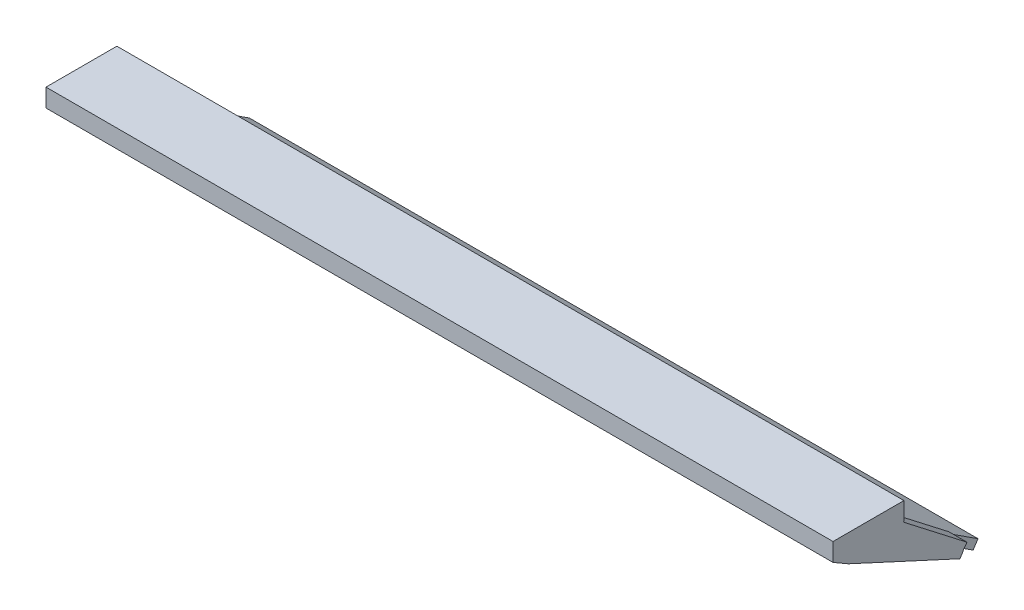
ISO-10303-21;
HEADER;
FILE_DESCRIPTION(('STEP AP214'),'2;1');
FILE_NAME('part.step','',(''),(''),'','','');
FILE_SCHEMA(('AUTOMOTIVE_DESIGN { 1 0 10303 214 1 1 1 1 }'));
ENDSEC;
DATA;
#1=APPLICATION_CONTEXT('core data for automotive mechanical design processes');
#2=APPLICATION_PROTOCOL_DEFINITION('international standard','automotive_design',2000,#1);
#3=PRODUCT_CONTEXT('',#1,'mechanical');
#4=PRODUCT('Part','Part','',(#3));
#5=PRODUCT_RELATED_PRODUCT_CATEGORY('part','',(#4));
#6=PRODUCT_DEFINITION_FORMATION('','',#4);
#7=PRODUCT_DEFINITION_CONTEXT('part definition',#1,'design');
#8=PRODUCT_DEFINITION('design','',#6,#7);
#9=PRODUCT_DEFINITION_SHAPE('','',#8);
#10=(LENGTH_UNIT() NAMED_UNIT(*) SI_UNIT(.MILLI.,.METRE.));
#11=(NAMED_UNIT(*) PLANE_ANGLE_UNIT() SI_UNIT($,.RADIAN.));
#12=(NAMED_UNIT(*) SI_UNIT($,.STERADIAN.) SOLID_ANGLE_UNIT());
#13=UNCERTAINTY_MEASURE_WITH_UNIT(LENGTH_MEASURE(1.E-05),#10,'distance_accuracy_value','');
#14=(GEOMETRIC_REPRESENTATION_CONTEXT(3) GLOBAL_UNCERTAINTY_ASSIGNED_CONTEXT((#13)) GLOBAL_UNIT_ASSIGNED_CONTEXT((#10,
#11,#12)) REPRESENTATION_CONTEXT('',''));
#15=CARTESIAN_POINT('',(0.,0.,0.));
#16=DIRECTION('',(0.,0.,1.));
#17=DIRECTION('',(1.,0.,0.));
#18=AXIS2_PLACEMENT_3D('',#15,#16,#17);
#19=CARTESIAN_POINT('',(69.5,1.55774974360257,-3.44671260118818));
#20=DIRECTION('',(0.,-0.839124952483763,0.54393870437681));
#21=DIRECTION('',(0.,-0.54393870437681,-0.839124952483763));
#22=AXIS2_PLACEMENT_3D('',#19,#20,#21);
#23=PLANE('',#22);
#24=DIRECTION('',(0.,-0.54393870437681,-0.839124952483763));
#25=VECTOR('',#24,1.);
#26=CARTESIAN_POINT('',(-40.9891534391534,-13.5697568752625,-26.7836587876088));
#27=LINE('',#26,#25);
#28=CARTESIAN_POINT('',(-40.9891534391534,-4.48943409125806,-12.7755998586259));
#29=VERTEX_POINT('',#28);
#30=CARTESIAN_POINT('',(-40.9891534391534,-13.5697568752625,-26.7836587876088));
#31=VERTEX_POINT('',#30);
#32=EDGE_CURVE('E446',#29,#31,#27,.T.);
#33=ORIENTED_EDGE('',*,*,#32,.F.);
#34=DIRECTION('',(-1.,0.,0.));
#35=VECTOR('',#34,1.);
#36=CARTESIAN_POINT('',(-33.0703703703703,-4.48943409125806,-12.7755998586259));
#37=LINE('',#36,#35);
#38=CARTESIAN_POINT('',(-33.0703703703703,-4.48943409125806,-12.7755998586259));
#39=VERTEX_POINT('',#38);
#40=EDGE_CURVE('E444',#39,#29,#37,.T.);
#41=ORIENTED_EDGE('',*,*,#40,.F.);
#42=DIRECTION('',(0.,0.54393870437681,0.839124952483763));
#43=VECTOR('',#42,1.);
#44=CARTESIAN_POINT('',(-33.0703703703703,-13.5697568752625,-26.7836587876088));
#45=LINE('',#44,#43);
#46=CARTESIAN_POINT('',(-33.0703703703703,-13.5697568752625,-26.7836587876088));
#47=VERTEX_POINT('',#46);
#48=EDGE_CURVE('E413',#47,#39,#45,.T.);
#49=ORIENTED_EDGE('',*,*,#48,.F.);
#50=DIRECTION('',(1.,0.,0.));
#51=VECTOR('',#50,1.);
#52=CARTESIAN_POINT('',(-33.0703703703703,-13.5697568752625,-26.7836587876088));
#53=LINE('',#52,#51);
#54=EDGE_CURVE('E448',#31,#47,#53,.T.);
#55=ORIENTED_EDGE('',*,*,#54,.F.);
#56=EDGE_LOOP('',(#33,#41,#49,#55));
#57=FACE_BOUND('',#56,.T.);
#58=DIRECTION('',(-1.,0.,0.));
#59=VECTOR('',#58,1.);
#60=CARTESIAN_POINT('',(-3.07037037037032,-4.48943409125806,-12.7755998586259));
#61=LINE('',#60,#59);
#62=CARTESIAN_POINT('',(-3.07037037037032,-4.48943409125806,-12.7755998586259));
#63=VERTEX_POINT('',#62);
#64=CARTESIAN_POINT('',(-10.9891534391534,-4.48943409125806,-12.7755998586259));
#65=VERTEX_POINT('',#64);
#66=EDGE_CURVE('E500',#63,#65,#61,.T.);
#67=ORIENTED_EDGE('',*,*,#66,.F.);
#68=DIRECTION('',(0.,0.54393870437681,0.839124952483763));
#69=VECTOR('',#68,1.);
#70=CARTESIAN_POINT('',(-3.07037037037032,-13.5697568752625,-26.7836587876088));
#71=LINE('',#70,#69);
#72=CARTESIAN_POINT('',(-3.07037037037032,-13.5697568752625,-26.7836587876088));
#73=VERTEX_POINT('',#72);
#74=EDGE_CURVE('E497',#73,#63,#71,.T.);
#75=ORIENTED_EDGE('',*,*,#74,.F.);
#76=DIRECTION('',(1.,0.,0.));
#77=VECTOR('',#76,1.);
#78=CARTESIAN_POINT('',(-3.07037037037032,-13.5697568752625,-26.7836587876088));
#79=LINE('',#78,#77);
#80=CARTESIAN_POINT('',(-10.9891534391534,-13.5697568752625,-26.7836587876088));
#81=VERTEX_POINT('',#80);
#82=EDGE_CURVE('E505',#81,#73,#79,.T.);
#83=ORIENTED_EDGE('',*,*,#82,.F.);
#84=DIRECTION('',(0.,-0.54393870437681,-0.839124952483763));
#85=VECTOR('',#84,1.);
#86=CARTESIAN_POINT('',(-10.9891534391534,-13.5697568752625,-26.7836587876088));
#87=LINE('',#86,#85);
#88=EDGE_CURVE('E503',#65,#81,#87,.T.);
#89=ORIENTED_EDGE('',*,*,#88,.F.);
#90=EDGE_LOOP('',(#67,#75,#83,#89));
#91=FACE_BOUND('',#90,.T.);
#92=DIRECTION('',(0.,-0.54393870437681,-0.839124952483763));
#93=VECTOR('',#92,1.);
#94=CARTESIAN_POINT('',(19.0108465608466,-13.5697568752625,-26.7836587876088));
#95=LINE('',#94,#93);
#96=CARTESIAN_POINT('',(19.0108465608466,-4.48943409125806,-12.7755998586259));
#97=VERTEX_POINT('',#96);
#98=CARTESIAN_POINT('',(19.0108465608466,-13.5697568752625,-26.7836587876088));
#99=VERTEX_POINT('',#98);
#100=EDGE_CURVE('E560',#97,#99,#95,.T.);
#101=ORIENTED_EDGE('',*,*,#100,.F.);
#102=DIRECTION('',(-1.,0.,0.));
#103=VECTOR('',#102,1.);
#104=CARTESIAN_POINT('',(26.9296296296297,-4.48943409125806,-12.7755998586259));
#105=LINE('',#104,#103);
#106=CARTESIAN_POINT('',(26.9296296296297,-4.48943409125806,-12.7755998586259));
#107=VERTEX_POINT('',#106);
#108=EDGE_CURVE('E558',#107,#97,#105,.T.);
#109=ORIENTED_EDGE('',*,*,#108,.F.);
#110=DIRECTION('',(0.,0.54393870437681,0.839124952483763));
#111=VECTOR('',#110,1.);
#112=CARTESIAN_POINT('',(26.9296296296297,-13.5697568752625,-26.7836587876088));
#113=LINE('',#112,#111);
#114=CARTESIAN_POINT('',(26.9296296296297,-13.5697568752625,-26.7836587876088));
#115=VERTEX_POINT('',#114);
#116=EDGE_CURVE('E555',#115,#107,#113,.T.);
#117=ORIENTED_EDGE('',*,*,#116,.F.);
#118=DIRECTION('',(1.,0.,0.));
#119=VECTOR('',#118,1.);
#120=CARTESIAN_POINT('',(26.9296296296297,-13.5697568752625,-26.7836587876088));
#121=LINE('',#120,#119);
#122=EDGE_CURVE('E563',#99,#115,#121,.T.);
#123=ORIENTED_EDGE('',*,*,#122,.F.);
#124=EDGE_LOOP('',(#101,#109,#117,#123));
#125=FACE_BOUND('',#124,.T.);
#126=DIRECTION('',(0.,-0.54393870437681,-0.839124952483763));
#127=VECTOR('',#126,1.);
#128=CARTESIAN_POINT('',(49.0108465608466,-13.5697568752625,-26.7836587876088));
#129=LINE('',#128,#127);
#130=CARTESIAN_POINT('',(49.0108465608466,-4.48943409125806,-12.7755998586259));
#131=VERTEX_POINT('',#130);
#132=CARTESIAN_POINT('',(49.0108465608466,-13.5697568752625,-26.7836587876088));
#133=VERTEX_POINT('',#132);
#134=EDGE_CURVE('E619',#131,#133,#129,.T.);
#135=ORIENTED_EDGE('',*,*,#134,.F.);
#136=DIRECTION('',(-1.,0.,0.));
#137=VECTOR('',#136,1.);
#138=CARTESIAN_POINT('',(56.9296296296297,-4.48943409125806,-12.7755998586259));
#139=LINE('',#138,#137);
#140=CARTESIAN_POINT('',(56.9296296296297,-4.48943409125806,-12.7755998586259));
#141=VERTEX_POINT('',#140);
#142=EDGE_CURVE('E616',#141,#131,#139,.T.);
#143=ORIENTED_EDGE('',*,*,#142,.F.);
#144=DIRECTION('',(0.,0.54393870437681,0.839124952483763));
#145=VECTOR('',#144,1.);
#146=CARTESIAN_POINT('',(56.9296296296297,-13.5697568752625,-26.7836587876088));
#147=LINE('',#146,#145);
#148=CARTESIAN_POINT('',(56.9296296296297,-13.5697568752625,-26.7836587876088));
#149=VERTEX_POINT('',#148);
#150=EDGE_CURVE('E613',#149,#141,#147,.T.);
#151=ORIENTED_EDGE('',*,*,#150,.F.);
#152=DIRECTION('',(1.,0.,0.));
#153=VECTOR('',#152,1.);
#154=CARTESIAN_POINT('',(56.9296296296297,-13.5697568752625,-26.7836587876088));
#155=LINE('',#154,#153);
#156=EDGE_CURVE('E621',#133,#149,#155,.T.);
#157=ORIENTED_EDGE('',*,*,#156,.F.);
#158=EDGE_LOOP('',(#135,#143,#151,#157));
#159=FACE_BOUND('',#158,.T.);
#160=DIRECTION('',(-1.,0.,0.));
#161=VECTOR('',#160,1.);
#162=CARTESIAN_POINT('',(69.5,-10.9065327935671,-22.6751484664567));
#163=LINE('',#162,#161);
#164=CARTESIAN_POINT('',(-65.2764550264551,-10.9065327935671,-22.6751484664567));
#165=VERTEX_POINT('',#164);
#166=CARTESIAN_POINT('',(-70.5,-10.9065327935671,-22.6751484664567));
#167=VERTEX_POINT('',#166);
#168=EDGE_CURVE('E653',#165,#167,#163,.T.);
#169=ORIENTED_EDGE('',*,*,#168,.F.);
#170=DIRECTION('',(0.,0.54393870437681,0.839124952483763));
#171=VECTOR('',#170,1.);
#172=CARTESIAN_POINT('',(-65.2764550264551,1.55774974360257,-3.44671260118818));
#173=LINE('',#172,#171);
#174=CARTESIAN_POINT('',(-65.2764550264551,-15.86709783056,-30.3277274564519));
#175=VERTEX_POINT('',#174);
#176=EDGE_CURVE('E650',#175,#165,#173,.T.);
#177=ORIENTED_EDGE('',*,*,#176,.F.);
#178=DIRECTION('',(-1.,0.,0.));
#179=VECTOR('',#178,1.);
#180=CARTESIAN_POINT('',(69.5,-15.86709783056,-30.3277274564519));
#181=LINE('',#180,#179);
#182=CARTESIAN_POINT('',(65.2764550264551,-15.86709783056,-30.3277274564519));
#183=VERTEX_POINT('',#182);
#184=EDGE_CURVE('E719',#183,#175,#181,.T.);
#185=ORIENTED_EDGE('',*,*,#184,.F.);
#186=DIRECTION('',(0.,-0.54393870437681,-0.839124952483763));
#187=VECTOR('',#186,1.);
#188=CARTESIAN_POINT('',(65.2764550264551,1.55774974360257,-3.44671260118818));
#189=LINE('',#188,#187);
#190=CARTESIAN_POINT('',(65.2764550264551,-10.9065327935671,-22.6751484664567));
#191=VERTEX_POINT('',#190);
#192=EDGE_CURVE('E671',#191,#183,#189,.T.);
#193=ORIENTED_EDGE('',*,*,#192,.F.);
#194=DIRECTION('',(-1.,0.,0.));
#195=VECTOR('',#194,1.);
#196=CARTESIAN_POINT('',(69.5,-10.9065327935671,-22.6751484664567));
#197=LINE('',#196,#195);
#198=CARTESIAN_POINT('',(69.5,-10.9065327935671,-22.6751484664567));
#199=VERTEX_POINT('',#198);
#200=EDGE_CURVE('E667',#199,#191,#197,.T.);
#201=ORIENTED_EDGE('',*,*,#200,.F.);
#202=DIRECTION('',(0.,0.54393870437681,0.839124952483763));
#203=VECTOR('',#202,1.);
#204=CARTESIAN_POINT('',(69.5,1.55774974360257,-3.44671260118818));
#205=LINE('',#204,#203);
#206=CARTESIAN_POINT('',(69.5,-10.4455919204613,-21.9640628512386));
#207=VERTEX_POINT('',#206);
#208=EDGE_CURVE('E716',#199,#207,#205,.T.);
#209=ORIENTED_EDGE('',*,*,#208,.T.);
#210=DIRECTION('',(-1.,0.,0.));
#211=VECTOR('',#210,1.);
#212=CARTESIAN_POINT('',(67.25,-10.4455919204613,-21.9640628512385));
#213=LINE('',#212,#211);
#214=CARTESIAN_POINT('',(67.25,-10.4455919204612,-21.9640628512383));
#215=VERTEX_POINT('',#214);
#216=EDGE_CURVE('E729',#207,#215,#213,.T.);
#217=ORIENTED_EDGE('',*,*,#216,.T.);
#218=DIRECTION('',(0.,-0.54393870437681,-0.839124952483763));
#219=VECTOR('',#218,1.);
#220=CARTESIAN_POINT('',(67.25,-11.1289550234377,-23.0182754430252));
#221=LINE('',#220,#219);
#222=CARTESIAN_POINT('',(67.25,0.,-5.84982653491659));
#223=VERTEX_POINT('',#222);
#224=EDGE_CURVE('E777',#223,#215,#221,.T.);
#225=ORIENTED_EDGE('',*,*,#224,.F.);
#226=DIRECTION('',(1.,0.,0.));
#227=VECTOR('',#226,1.);
#228=CARTESIAN_POINT('',(70.5,0.,-5.84982653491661));
#229=LINE('',#228,#227);
#230=CARTESIAN_POINT('',(-67.25,0.,-5.8498265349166));
#231=VERTEX_POINT('',#230);
#232=EDGE_CURVE('E731',#231,#223,#229,.T.);
#233=ORIENTED_EDGE('',*,*,#232,.F.);
#234=DIRECTION('',(0.,-0.54393870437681,-0.839124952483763));
#235=VECTOR('',#234,1.);
#236=CARTESIAN_POINT('',(-67.25,1.55774974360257,-3.44671260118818));
#237=LINE('',#236,#235);
#238=CARTESIAN_POINT('',(-67.25,-10.4455919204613,-21.9640628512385));
#239=VERTEX_POINT('',#238);
#240=EDGE_CURVE('E700',#231,#239,#237,.T.);
#241=ORIENTED_EDGE('',*,*,#240,.T.);
#242=DIRECTION('',(-1.,0.,0.));
#243=VECTOR('',#242,1.);
#244=CARTESIAN_POINT('',(69.5,-10.4455919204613,-21.9640628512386));
#245=LINE('',#244,#243);
#246=CARTESIAN_POINT('',(-70.5,-10.4455919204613,-21.9640628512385));
#247=VERTEX_POINT('',#246);
#248=EDGE_CURVE('E790',#239,#247,#245,.T.);
#249=ORIENTED_EDGE('',*,*,#248,.T.);
#250=DIRECTION('',(0.,0.54393870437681,0.839124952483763));
#251=VECTOR('',#250,1.);
#252=CARTESIAN_POINT('',(-70.5,1.55774974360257,-3.44671260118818));
#253=LINE('',#252,#251);
#254=EDGE_CURVE('E711',#167,#247,#253,.T.);
#255=ORIENTED_EDGE('',*,*,#254,.F.);
#256=EDGE_LOOP('',(#169,#177,#185,#193,#201,#209,#217,#225,#233,#241,#249,#255));
#257=FACE_BOUND('',#256,.T.);
#258=DIRECTION('',(0.,-0.54393870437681,-0.839124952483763));
#259=VECTOR('',#258,1.);
#260=CARTESIAN_POINT('',(34.0108465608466,-13.5697568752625,-26.7836587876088));
#261=LINE('',#260,#259);
#262=CARTESIAN_POINT('',(34.0108465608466,-4.48943409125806,-12.7755998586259));
#263=VERTEX_POINT('',#262);
#264=CARTESIAN_POINT('',(34.0108465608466,-13.5697568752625,-26.7836587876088));
#265=VERTEX_POINT('',#264);
#266=EDGE_CURVE('E589',#263,#265,#261,.T.);
#267=ORIENTED_EDGE('',*,*,#266,.F.);
#268=DIRECTION('',(-1.,0.,0.));
#269=VECTOR('',#268,1.);
#270=CARTESIAN_POINT('',(41.9296296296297,-4.48943409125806,-12.7755998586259));
#271=LINE('',#270,#269);
#272=CARTESIAN_POINT('',(41.9296296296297,-4.48943409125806,-12.7755998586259));
#273=VERTEX_POINT('',#272);
#274=EDGE_CURVE('E587',#273,#263,#271,.T.);
#275=ORIENTED_EDGE('',*,*,#274,.F.);
#276=DIRECTION('',(0.,0.54393870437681,0.839124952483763));
#277=VECTOR('',#276,1.);
#278=CARTESIAN_POINT('',(41.9296296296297,-13.5697568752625,-26.7836587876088));
#279=LINE('',#278,#277);
#280=CARTESIAN_POINT('',(41.9296296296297,-13.5697568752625,-26.7836587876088));
#281=VERTEX_POINT('',#280);
#282=EDGE_CURVE('E584',#281,#273,#279,.T.);
#283=ORIENTED_EDGE('',*,*,#282,.F.);
#284=DIRECTION('',(1.,0.,0.));
#285=VECTOR('',#284,1.);
#286=CARTESIAN_POINT('',(41.9296296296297,-13.5697568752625,-26.7836587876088));
#287=LINE('',#286,#285);
#288=EDGE_CURVE('E592',#265,#281,#287,.T.);
#289=ORIENTED_EDGE('',*,*,#288,.F.);
#290=EDGE_LOOP('',(#267,#275,#283,#289));
#291=FACE_BOUND('',#290,.T.);
#292=DIRECTION('',(-1.,0.,0.));
#293=VECTOR('',#292,1.);
#294=CARTESIAN_POINT('',(11.9296296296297,-4.48943409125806,-12.7755998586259));
#295=LINE('',#294,#293);
#296=CARTESIAN_POINT('',(11.9296296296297,-4.48943409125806,-12.7755998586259));
#297=VERTEX_POINT('',#296);
#298=CARTESIAN_POINT('',(4.01084656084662,-4.48943409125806,-12.7755998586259));
#299=VERTEX_POINT('',#298);
#300=EDGE_CURVE('E529',#297,#299,#295,.T.);
#301=ORIENTED_EDGE('',*,*,#300,.F.);
#302=DIRECTION('',(0.,0.54393870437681,0.839124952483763));
#303=VECTOR('',#302,1.);
#304=CARTESIAN_POINT('',(11.9296296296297,-13.5697568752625,-26.7836587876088));
#305=LINE('',#304,#303);
#306=CARTESIAN_POINT('',(11.9296296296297,-13.5697568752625,-26.7836587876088));
#307=VERTEX_POINT('',#306);
#308=EDGE_CURVE('E526',#307,#297,#305,.T.);
#309=ORIENTED_EDGE('',*,*,#308,.F.);
#310=DIRECTION('',(1.,0.,0.));
#311=VECTOR('',#310,1.);
#312=CARTESIAN_POINT('',(11.9296296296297,-13.5697568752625,-26.7836587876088));
#313=LINE('',#312,#311);
#314=CARTESIAN_POINT('',(4.01084656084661,-13.5697568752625,-26.7836587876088));
#315=VERTEX_POINT('',#314);
#316=EDGE_CURVE('E534',#315,#307,#313,.T.);
#317=ORIENTED_EDGE('',*,*,#316,.F.);
#318=DIRECTION('',(0.,-0.54393870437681,-0.839124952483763));
#319=VECTOR('',#318,1.);
#320=CARTESIAN_POINT('',(4.01084656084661,-13.5697568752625,-26.7836587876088));
#321=LINE('',#320,#319);
#322=EDGE_CURVE('E532',#299,#315,#321,.T.);
#323=ORIENTED_EDGE('',*,*,#322,.F.);
#324=EDGE_LOOP('',(#301,#309,#317,#323));
#325=FACE_BOUND('',#324,.T.);
#326=DIRECTION('',(0.,-0.54393870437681,-0.839124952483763));
#327=VECTOR('',#326,1.);
#328=CARTESIAN_POINT('',(-25.9891534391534,-13.5697568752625,-26.7836587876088));
#329=LINE('',#328,#327);
#330=CARTESIAN_POINT('',(-25.9891534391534,-4.48943409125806,-12.7755998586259));
#331=VERTEX_POINT('',#330);
#332=CARTESIAN_POINT('',(-25.9891534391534,-13.5697568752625,-26.7836587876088));
#333=VERTEX_POINT('',#332);
#334=EDGE_CURVE('E474',#331,#333,#329,.T.);
#335=ORIENTED_EDGE('',*,*,#334,.F.);
#336=DIRECTION('',(-1.,0.,0.));
#337=VECTOR('',#336,1.);
#338=CARTESIAN_POINT('',(-18.0703703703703,-4.48943409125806,-12.7755998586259));
#339=LINE('',#338,#337);
#340=CARTESIAN_POINT('',(-18.0703703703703,-4.48943409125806,-12.7755998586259));
#341=VERTEX_POINT('',#340);
#342=EDGE_CURVE('E471',#341,#331,#339,.T.);
#343=ORIENTED_EDGE('',*,*,#342,.F.);
#344=DIRECTION('',(0.,0.54393870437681,0.839124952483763));
#345=VECTOR('',#344,1.);
#346=CARTESIAN_POINT('',(-18.0703703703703,-13.5697568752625,-26.7836587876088));
#347=LINE('',#346,#345);
#348=CARTESIAN_POINT('',(-18.0703703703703,-13.5697568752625,-26.7836587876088));
#349=VERTEX_POINT('',#348);
#350=EDGE_CURVE('E468',#349,#341,#347,.T.);
#351=ORIENTED_EDGE('',*,*,#350,.F.);
#352=DIRECTION('',(1.,0.,0.));
#353=VECTOR('',#352,1.);
#354=CARTESIAN_POINT('',(-18.0703703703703,-13.5697568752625,-26.7836587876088));
#355=LINE('',#354,#353);
#356=EDGE_CURVE('E476',#333,#349,#355,.T.);
#357=ORIENTED_EDGE('',*,*,#356,.F.);
#358=EDGE_LOOP('',(#335,#343,#351,#357));
#359=FACE_BOUND('',#358,.T.);
#360=DIRECTION('',(0.,-0.54393870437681,-0.839124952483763));
#361=VECTOR('',#360,1.);
#362=CARTESIAN_POINT('',(-55.9891534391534,-13.5697568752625,-26.7836587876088));
#363=LINE('',#362,#361);
#364=CARTESIAN_POINT('',(-55.9891534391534,-4.48943409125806,-12.7755998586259));
#365=VERTEX_POINT('',#364);
#366=CARTESIAN_POINT('',(-55.9891534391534,-13.5697568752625,-26.7836587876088));
#367=VERTEX_POINT('',#366);
#368=EDGE_CURVE('E424',#365,#367,#363,.T.);
#369=ORIENTED_EDGE('',*,*,#368,.F.);
#370=DIRECTION('',(-1.,0.,0.));
#371=VECTOR('',#370,1.);
#372=CARTESIAN_POINT('',(-48.0703703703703,-4.48943409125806,-12.7755998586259));
#373=LINE('',#372,#371);
#374=CARTESIAN_POINT('',(-48.0703703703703,-4.48943409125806,-12.7755998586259));
#375=VERTEX_POINT('',#374);
#376=EDGE_CURVE('E407',#375,#365,#373,.T.);
#377=ORIENTED_EDGE('',*,*,#376,.F.);
#378=DIRECTION('',(0.,0.54393870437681,0.839124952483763));
#379=VECTOR('',#378,1.);
#380=CARTESIAN_POINT('',(-48.0703703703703,-13.5697568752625,-26.7836587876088));
#381=LINE('',#380,#379);
#382=CARTESIAN_POINT('',(-48.0703703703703,-13.5697568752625,-26.7836587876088));
#383=VERTEX_POINT('',#382);
#384=EDGE_CURVE('E417',#383,#375,#381,.T.);
#385=ORIENTED_EDGE('',*,*,#384,.F.);
#386=DIRECTION('',(1.,0.,0.));
#387=VECTOR('',#386,1.);
#388=CARTESIAN_POINT('',(-48.0703703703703,-13.5697568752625,-26.7836587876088));
#389=LINE('',#388,#387);
#390=EDGE_CURVE('E426',#367,#383,#389,.T.);
#391=ORIENTED_EDGE('',*,*,#390,.F.);
#392=EDGE_LOOP('',(#369,#377,#385,#391));
#393=FACE_BOUND('',#392,.T.);
#394=ADVANCED_FACE('F38',(#57,#91,#125,#159,#257,#291,#325,#359,#393),#23,.T.);
#395=CARTESIAN_POINT('',(69.5,2.90034966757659,-4.31701452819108));
#396=DIRECTION('',(0.,0.839124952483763,-0.54393870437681));
#397=DIRECTION('',(0.,0.54393870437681,0.839124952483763));
#398=AXIS2_PLACEMENT_3D('',#395,#396,#397);
#399=PLANE('',#398);
#400=DIRECTION('',(1.,0.,0.));
#401=VECTOR('',#400,1.);
#402=CARTESIAN_POINT('',(-70.5,-9.56393286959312,-23.5454503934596));
#403=LINE('',#402,#401);
#404=CARTESIAN_POINT('',(-70.5,-9.56393286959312,-23.5454503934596));
#405=VERTEX_POINT('',#404);
#406=CARTESIAN_POINT('',(-65.2764550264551,-9.56393286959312,-23.5454503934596));
#407=VERTEX_POINT('',#406);
#408=EDGE_CURVE('E642',#405,#407,#403,.T.);
#409=ORIENTED_EDGE('',*,*,#408,.F.);
#410=DIRECTION('',(0.,-0.54393870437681,-0.839124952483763));
#411=VECTOR('',#410,1.);
#412=CARTESIAN_POINT('',(-70.5,2.90034966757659,-4.31701452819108));
#413=LINE('',#412,#411);
#414=CARTESIAN_POINT('',(-70.5,-9.53957026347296,-23.5078666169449));
#415=VERTEX_POINT('',#414);
#416=EDGE_CURVE('E708',#415,#405,#413,.T.);
#417=ORIENTED_EDGE('',*,*,#416,.F.);
#418=DIRECTION('',(1.,0.,0.));
#419=VECTOR('',#418,1.);
#420=CARTESIAN_POINT('',(69.5,-9.53957026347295,-23.5078666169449));
#421=LINE('',#420,#419);
#422=CARTESIAN_POINT('',(-67.25,-9.53957026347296,-23.5078666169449));
#423=VERTEX_POINT('',#422);
#424=EDGE_CURVE('E787',#415,#423,#421,.T.);
#425=ORIENTED_EDGE('',*,*,#424,.T.);
#426=DIRECTION('',(0.,0.54393870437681,0.839124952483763));
#427=VECTOR('',#426,1.);
#428=CARTESIAN_POINT('',(-67.25,2.90034966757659,-4.31701452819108));
#429=LINE('',#428,#427);
#430=CARTESIAN_POINT('',(-67.25,0.,-8.79133444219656));
#431=VERTEX_POINT('',#430);
#432=EDGE_CURVE('E784',#423,#431,#429,.T.);
#433=ORIENTED_EDGE('',*,*,#432,.T.);
#434=DIRECTION('',(-1.,0.,0.));
#435=VECTOR('',#434,1.);
#436=CARTESIAN_POINT('',(70.5,0.,-8.79133444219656));
#437=LINE('',#436,#435);
#438=CARTESIAN_POINT('',(67.25,0.,-8.79133444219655));
#439=VERTEX_POINT('',#438);
#440=EDGE_CURVE('E726',#439,#431,#437,.T.);
#441=ORIENTED_EDGE('',*,*,#440,.F.);
#442=DIRECTION('',(0.,0.54393870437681,0.839124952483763));
#443=VECTOR('',#442,1.);
#444=CARTESIAN_POINT('',(67.25,-9.78635509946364,-23.8885773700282));
#445=LINE('',#444,#443);
#446=CARTESIAN_POINT('',(67.25,-9.53957026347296,-23.5078666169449));
#447=VERTEX_POINT('',#446);
#448=EDGE_CURVE('E774',#447,#439,#445,.T.);
#449=ORIENTED_EDGE('',*,*,#448,.F.);
#450=DIRECTION('',(1.,0.,0.));
#451=VECTOR('',#450,1.);
#452=CARTESIAN_POINT('',(67.25,-9.53957026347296,-23.5078666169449));
#453=LINE('',#452,#451);
#454=CARTESIAN_POINT('',(69.5,-9.53957026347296,-23.5078666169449));
#455=VERTEX_POINT('',#454);
#456=EDGE_CURVE('E722',#447,#455,#453,.T.);
#457=ORIENTED_EDGE('',*,*,#456,.T.);
#458=DIRECTION('',(0.,-0.54393870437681,-0.839124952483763));
#459=VECTOR('',#458,1.);
#460=CARTESIAN_POINT('',(69.5,2.90034966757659,-4.31701452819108));
#461=LINE('',#460,#459);
#462=CARTESIAN_POINT('',(69.5,-9.56393286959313,-23.5454503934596));
#463=VERTEX_POINT('',#462);
#464=EDGE_CURVE('E713',#455,#463,#461,.T.);
#465=ORIENTED_EDGE('',*,*,#464,.T.);
#466=DIRECTION('',(1.,0.,0.));
#467=VECTOR('',#466,1.);
#468=CARTESIAN_POINT('',(70.5,-9.56393286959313,-23.5454503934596));
#469=LINE('',#468,#467);
#470=CARTESIAN_POINT('',(65.2764550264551,-9.56393286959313,-23.5454503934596));
#471=VERTEX_POINT('',#470);
#472=EDGE_CURVE('E658',#471,#463,#469,.T.);
#473=ORIENTED_EDGE('',*,*,#472,.F.);
#474=DIRECTION('',(0.,0.54393870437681,0.839124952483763));
#475=VECTOR('',#474,1.);
#476=CARTESIAN_POINT('',(65.2764550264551,-9.56393286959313,-23.5454503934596));
#477=LINE('',#476,#475);
#478=CARTESIAN_POINT('',(65.2764550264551,-14.5244979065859,-31.1980293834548));
#479=VERTEX_POINT('',#478);
#480=EDGE_CURVE('E655',#479,#471,#477,.T.);
#481=ORIENTED_EDGE('',*,*,#480,.F.);
#482=DIRECTION('',(-1.,0.,0.));
#483=VECTOR('',#482,1.);
#484=CARTESIAN_POINT('',(69.5,-14.5244979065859,-31.1980293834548));
#485=LINE('',#484,#483);
#486=CARTESIAN_POINT('',(-65.2764550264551,-14.5244979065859,-31.1980293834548));
#487=VERTEX_POINT('',#486);
#488=EDGE_CURVE('E718',#479,#487,#485,.T.);
#489=ORIENTED_EDGE('',*,*,#488,.T.);
#490=DIRECTION('',(0.,-0.54393870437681,-0.839124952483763));
#491=VECTOR('',#490,1.);
#492=CARTESIAN_POINT('',(-65.2764550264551,-9.56393286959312,-23.5454503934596));
#493=LINE('',#492,#491);
#494=EDGE_CURVE('E645',#407,#487,#493,.T.);
#495=ORIENTED_EDGE('',*,*,#494,.F.);
#496=EDGE_LOOP('',(#409,#417,#425,#433,#441,#449,#457,#465,#473,#481,#489,#495));
#497=FACE_BOUND('',#496,.T.);
#498=ADVANCED_FACE('F847',(#497),#399,.T.);
#499=CARTESIAN_POINT('',(69.5,1.55774974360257,-3.44671260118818));
#500=DIRECTION('',(1.,0.,0.));
#501=DIRECTION('',(0.,0.,-1.));
#502=AXIS2_PLACEMENT_3D('',#499,#500,#501);
#503=PLANE('',#502);
#504=DIRECTION('',(0.,-0.839124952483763,0.54393870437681));
#505=VECTOR('',#504,1.);
#506=CARTESIAN_POINT('',(69.5,-10.9065327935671,-22.6751484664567));
#507=LINE('',#506,#505);
#508=CARTESIAN_POINT('',(69.5,-10.1009623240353,-23.1973364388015));
#509=VERTEX_POINT('',#508);
#510=EDGE_CURVE('E1683',#463,#509,#507,.T.);
#511=ORIENTED_EDGE('',*,*,#510,.F.);
#512=ORIENTED_EDGE('',*,*,#464,.F.);
#513=DIRECTION('',(0.,-0.80881044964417,0.588069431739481));
#514=VECTOR('',#513,1.);
#515=CARTESIAN_POINT('',(69.5,-8.86270695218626,-24.));
#516=LINE('',#515,#514);
#517=CARTESIAN_POINT('',(69.5,-9.73423800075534,-23.3663277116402));
#518=VERTEX_POINT('',#517);
#519=EDGE_CURVE('E736',#455,#518,#516,.T.);
#520=ORIENTED_EDGE('',*,*,#519,.T.);
#521=DIRECTION('',(0.,-0.908209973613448,0.418514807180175));
#522=VECTOR('',#521,1.);
#523=CARTESIAN_POINT('',(69.5,-10.8539949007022,-22.8503293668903));
#524=LINE('',#523,#522);
#525=EDGE_CURVE('E733',#518,#509,#524,.T.);
#526=ORIENTED_EDGE('',*,*,#525,.T.);
#527=EDGE_LOOP('',(#511,#512,#520,#526));
#528=FACE_BOUND('',#527,.T.);
#529=ADVANCED_FACE('F901',(#528),#503,.T.);
#530=CARTESIAN_POINT('',(70.5,0.,-12.7));
#531=DIRECTION('',(0.,1.,0.));
#532=DIRECTION('',(0.,0.,1.));
#533=AXIS2_PLACEMENT_3D('',#530,#531,#532);
#534=PLANE('',#533);
#535=DIRECTION('',(-1.,0.,0.));
#536=VECTOR('',#535,1.);
#537=CARTESIAN_POINT('',(-67.25,0.,-12.5467094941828));
#538=LINE('',#537,#536);
#539=CARTESIAN_POINT('',(-67.25,0.,-12.5467094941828));
#540=VERTEX_POINT('',#539);
#541=CARTESIAN_POINT('',(-70.5,0.,-12.5467094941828));
#542=VERTEX_POINT('',#541);
#543=EDGE_CURVE('E696',#540,#542,#538,.T.);
#544=ORIENTED_EDGE('',*,*,#543,.T.);
#545=DIRECTION('',(0.,0.,1.));
#546=VECTOR('',#545,1.);
#547=CARTESIAN_POINT('',(-70.5,0.,0.));
#548=LINE('',#547,#546);
#549=CARTESIAN_POINT('',(-70.5,0.,-12.7));
#550=VERTEX_POINT('',#549);
#551=EDGE_CURVE('E798',#550,#542,#548,.T.);
#552=ORIENTED_EDGE('',*,*,#551,.F.);
#553=DIRECTION('',(-1.,0.,0.));
#554=VECTOR('',#553,1.);
#555=CARTESIAN_POINT('',(70.5,0.,-12.7));
#556=LINE('',#555,#554);
#557=CARTESIAN_POINT('',(70.5,0.,-12.7));
#558=VERTEX_POINT('',#557);
#559=EDGE_CURVE('E811',#558,#550,#556,.T.);
#560=ORIENTED_EDGE('',*,*,#559,.F.);
#561=DIRECTION('',(0.,0.,-1.));
#562=VECTOR('',#561,1.);
#563=CARTESIAN_POINT('',(70.5,0.,0.));
#564=LINE('',#563,#562);
#565=CARTESIAN_POINT('',(70.5,0.,-12.5467094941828));
#566=VERTEX_POINT('',#565);
#567=EDGE_CURVE('E808',#566,#558,#564,.T.);
#568=ORIENTED_EDGE('',*,*,#567,.F.);
#569=DIRECTION('',(1.,0.,0.));
#570=VECTOR('',#569,1.);
#571=CARTESIAN_POINT('',(67.25,0.,-12.5467094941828));
#572=LINE('',#571,#570);
#573=CARTESIAN_POINT('',(67.25,0.,-12.5467094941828));
#574=VERTEX_POINT('',#573);
#575=EDGE_CURVE('E1660',#574,#566,#572,.T.);
#576=ORIENTED_EDGE('',*,*,#575,.F.);
#577=DIRECTION('',(0.,0.,1.));
#578=VECTOR('',#577,1.);
#579=CARTESIAN_POINT('',(67.25,0.,0.));
#580=LINE('',#579,#578);
#581=EDGE_CURVE('E765',#574,#439,#580,.T.);
#582=ORIENTED_EDGE('',*,*,#581,.T.);
#583=ORIENTED_EDGE('',*,*,#440,.T.);
#584=DIRECTION('',(0.,0.,1.));
#585=VECTOR('',#584,1.);
#586=CARTESIAN_POINT('',(-67.25,0.,0.));
#587=LINE('',#586,#585);
#588=EDGE_CURVE('E687',#540,#431,#587,.T.);
#589=ORIENTED_EDGE('',*,*,#588,.F.);
#590=EDGE_LOOP('',(#544,#552,#560,#568,#576,#582,#583,#589));
#591=FACE_BOUND('',#590,.T.);
#592=ADVANCED_FACE('F830',(#591),#534,.F.);
#593=CARTESIAN_POINT('',(-67.25,0.,0.));
#594=VERTEX_POINT('',#593);
#595=EDGE_CURVE('E686',#231,#594,#587,.T.);
#596=ORIENTED_EDGE('',*,*,#595,.F.);
#597=ORIENTED_EDGE('',*,*,#232,.T.);
#598=CARTESIAN_POINT('',(67.25,0.,0.));
#599=VERTEX_POINT('',#598);
#600=EDGE_CURVE('E758',#223,#599,#580,.T.);
#601=ORIENTED_EDGE('',*,*,#600,.T.);
#602=DIRECTION('',(1.,0.,0.));
#603=VECTOR('',#602,1.);
#604=CARTESIAN_POINT('',(70.5,0.,0.));
#605=LINE('',#604,#603);
#606=EDGE_CURVE('E794',#594,#599,#605,.T.);
#607=ORIENTED_EDGE('',*,*,#606,.F.);
#608=EDGE_LOOP('',(#596,#597,#601,#607));
#609=FACE_BOUND('',#608,.T.);
#610=ADVANCED_FACE('F939',(#609),#534,.F.);
#611=CARTESIAN_POINT('',(67.25,-12.7011953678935,-21.9991156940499));
#612=DIRECTION('',(1.,0.,0.));
#613=DIRECTION('',(0.,0.,-1.));
#614=AXIS2_PLACEMENT_3D('',#611,#612,#613);
#615=PLANE('',#614);
#616=ORIENTED_EDGE('',*,*,#600,.F.);
#617=ORIENTED_EDGE('',*,*,#224,.T.);
#618=DIRECTION('',(0.,-0.41851480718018,-0.908209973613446));
#619=VECTOR('',#618,1.);
#620=CARTESIAN_POINT('',(67.25,-1.60649969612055,-2.78253909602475));
#621=LINE('',#620,#619);
#622=CARTESIAN_POINT('',(67.25,-1.60649969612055,-2.78253909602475));
#623=VERTEX_POINT('',#622);
#624=EDGE_CURVE('E750',#623,#215,#621,.T.);
#625=ORIENTED_EDGE('',*,*,#624,.F.);
#626=DIRECTION('',(0.,-0.5,-0.866025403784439));
#627=VECTOR('',#626,1.);
#628=CARTESIAN_POINT('',(67.25,0.,0.));
#629=LINE('',#628,#627);
#630=EDGE_CURVE('E754',#599,#623,#629,.T.);
#631=ORIENTED_EDGE('',*,*,#630,.F.);
#632=EDGE_LOOP('',(#616,#617,#625,#631));
#633=FACE_BOUND('',#632,.T.);
#634=ADVANCED_FACE('F894',(#633),#615,.F.);
#635=CARTESIAN_POINT('',(70.5,3.25,0.));
#636=DIRECTION('',(-1.,0.,0.));
#637=DIRECTION('',(0.,0.,1.));
#638=AXIS2_PLACEMENT_3D('',#635,#636,#637);
#639=PLANE('',#638);
#640=DIRECTION('',(0.,-0.41851480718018,-0.908209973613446));
#641=VECTOR('',#640,1.);
#642=CARTESIAN_POINT('',(70.5,-1.60649969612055,-2.78253909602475));
#643=LINE('',#642,#641);
#644=CARTESIAN_POINT('',(70.5,-1.60649969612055,-2.78253909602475));
#645=VERTEX_POINT('',#644);
#646=CARTESIAN_POINT('',(70.5,-10.8039204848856,-22.7416639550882));
#647=VERTEX_POINT('',#646);
#648=EDGE_CURVE('E741',#645,#647,#643,.T.);
#649=ORIENTED_EDGE('',*,*,#648,.T.);
#650=DIRECTION('',(0.,0.839124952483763,-0.54393870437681));
#651=VECTOR('',#650,1.);
#652=CARTESIAN_POINT('',(70.5,-24.7491172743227,-13.7020897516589));
#653=LINE('',#652,#651);
#654=CARTESIAN_POINT('',(70.5,-10.1009623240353,-23.1973364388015));
#655=VERTEX_POINT('',#654);
#656=EDGE_CURVE('E661',#647,#655,#653,.T.);
#657=ORIENTED_EDGE('',*,*,#656,.T.);
#658=DIRECTION('',(0.,0.908209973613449,-0.418514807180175));
#659=VECTOR('',#658,1.);
#660=CARTESIAN_POINT('',(70.5,-10.8539949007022,-22.8503293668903));
#661=LINE('',#660,#659);
#662=CARTESIAN_POINT('',(70.5,-9.73423800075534,-23.3663277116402));
#663=VERTEX_POINT('',#662);
#664=EDGE_CURVE('E744',#655,#663,#661,.T.);
#665=ORIENTED_EDGE('',*,*,#664,.T.);
#666=DIRECTION('',(0.,0.808810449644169,-0.588069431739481));
#667=VECTOR('',#666,1.);
#668=CARTESIAN_POINT('',(70.5,-8.86270695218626,-24.));
#669=LINE('',#668,#667);
#670=CARTESIAN_POINT('',(70.5,-8.86270695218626,-24.));
#671=VERTEX_POINT('',#670);
#672=EDGE_CURVE('E746',#663,#671,#669,.T.);
#673=ORIENTED_EDGE('',*,*,#672,.T.);
#674=DIRECTION('',(0.,0.611985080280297,0.790869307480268));
#675=VECTOR('',#674,1.);
#676=CARTESIAN_POINT('',(70.5,0.,-12.5467094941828));
#677=LINE('',#676,#675);
#678=EDGE_CURVE('E749',#671,#566,#677,.T.);
#679=ORIENTED_EDGE('',*,*,#678,.T.);
#680=ORIENTED_EDGE('',*,*,#567,.T.);
#681=DIRECTION('',(0.,-1.,0.));
#682=VECTOR('',#681,1.);
#683=CARTESIAN_POINT('',(70.5,3.25,-12.7));
#684=LINE('',#683,#682);
#685=CARTESIAN_POINT('',(70.5,3.25,-12.7));
#686=VERTEX_POINT('',#685);
#687=EDGE_CURVE('E778',#686,#558,#684,.T.);
#688=ORIENTED_EDGE('',*,*,#687,.F.);
#689=DIRECTION('',(0.,0.,-1.));
#690=VECTOR('',#689,1.);
#691=CARTESIAN_POINT('',(70.5,3.25,0.));
#692=LINE('',#691,#690);
#693=CARTESIAN_POINT('',(70.5,3.25,0.));
#694=VERTEX_POINT('',#693);
#695=EDGE_CURVE('E803',#694,#686,#692,.T.);
#696=ORIENTED_EDGE('',*,*,#695,.F.);
#697=DIRECTION('',(0.,-1.,0.));
#698=VECTOR('',#697,1.);
#699=CARTESIAN_POINT('',(70.5,3.25,0.));
#700=LINE('',#699,#698);
#701=CARTESIAN_POINT('',(70.5,0.,0.));
#702=VERTEX_POINT('',#701);
#703=EDGE_CURVE('E872',#694,#702,#700,.T.);
#704=ORIENTED_EDGE('',*,*,#703,.T.);
#705=DIRECTION('',(0.,-0.5,-0.866025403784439));
#706=VECTOR('',#705,1.);
#707=CARTESIAN_POINT('',(70.5,0.,0.));
#708=LINE('',#707,#706);
#709=EDGE_CURVE('E738',#702,#645,#708,.T.);
#710=ORIENTED_EDGE('',*,*,#709,.T.);
#711=EDGE_LOOP('',(#649,#657,#665,#673,#679,#680,#688,#696,#704,#710));
#712=FACE_BOUND('',#711,.T.);
#713=ADVANCED_FACE('F40',(#712),#639,.F.);
#714=CARTESIAN_POINT('',(70.5,3.25,-12.7));
#715=DIRECTION('',(0.,0.,1.));
#716=DIRECTION('',(1.,0.,0.));
#717=AXIS2_PLACEMENT_3D('',#714,#715,#716);
#718=PLANE('',#717);
#719=ORIENTED_EDGE('',*,*,#559,.T.);
#720=DIRECTION('',(0.,-1.,0.));
#721=VECTOR('',#720,1.);
#722=CARTESIAN_POINT('',(-70.5,3.25,-12.7));
#723=LINE('',#722,#721);
#724=CARTESIAN_POINT('',(-70.5,3.25,-12.7));
#725=VERTEX_POINT('',#724);
#726=EDGE_CURVE('E828',#725,#550,#723,.T.);
#727=ORIENTED_EDGE('',*,*,#726,.F.);
#728=DIRECTION('',(-1.,0.,0.));
#729=VECTOR('',#728,1.);
#730=CARTESIAN_POINT('',(70.5,3.25,-12.7));
#731=LINE('',#730,#729);
#732=EDGE_CURVE('E879',#686,#725,#731,.T.);
#733=ORIENTED_EDGE('',*,*,#732,.F.);
#734=ORIENTED_EDGE('',*,*,#687,.T.);
#735=EDGE_LOOP('',(#719,#727,#733,#734));
#736=FACE_BOUND('',#735,.T.);
#737=ADVANCED_FACE('F887',(#736),#718,.F.);
#738=CARTESIAN_POINT('',(-70.5,3.25,0.));
#739=DIRECTION('',(1.,0.,0.));
#740=DIRECTION('',(0.,0.,-1.));
#741=AXIS2_PLACEMENT_3D('',#738,#739,#740);
#742=PLANE('',#741);
#743=ORIENTED_EDGE('',*,*,#416,.T.);
#744=DIRECTION('',(0.,0.839124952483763,-0.54393870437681));
#745=VECTOR('',#744,1.);
#746=CARTESIAN_POINT('',(-70.5,-24.7491172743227,-13.7020897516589));
#747=LINE('',#746,#745);
#748=EDGE_CURVE('E648',#167,#405,#747,.T.);
#749=ORIENTED_EDGE('',*,*,#748,.F.);
#750=ORIENTED_EDGE('',*,*,#254,.T.);
#751=DIRECTION('',(0.,-0.41851480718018,-0.908209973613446));
#752=VECTOR('',#751,1.);
#753=CARTESIAN_POINT('',(-70.5,-1.60649969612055,-2.78253909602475));
#754=LINE('',#753,#752);
#755=CARTESIAN_POINT('',(-70.5,-1.60649969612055,-2.78253909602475));
#756=VERTEX_POINT('',#755);
#757=EDGE_CURVE('E680',#756,#247,#754,.T.);
#758=ORIENTED_EDGE('',*,*,#757,.F.);
#759=DIRECTION('',(0.,-0.5,-0.866025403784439));
#760=VECTOR('',#759,1.);
#761=CARTESIAN_POINT('',(-70.5,0.,0.));
#762=LINE('',#761,#760);
#763=CARTESIAN_POINT('',(-70.5,0.,0.));
#764=VERTEX_POINT('',#763);
#765=EDGE_CURVE('E673',#764,#756,#762,.T.);
#766=ORIENTED_EDGE('',*,*,#765,.F.);
#767=DIRECTION('',(0.,-1.,0.));
#768=VECTOR('',#767,1.);
#769=CARTESIAN_POINT('',(-70.5,3.25,0.));
#770=LINE('',#769,#768);
#771=CARTESIAN_POINT('',(-70.5,3.25,0.));
#772=VERTEX_POINT('',#771);
#773=EDGE_CURVE('E866',#772,#764,#770,.T.);
#774=ORIENTED_EDGE('',*,*,#773,.F.);
#775=DIRECTION('',(0.,0.,1.));
#776=VECTOR('',#775,1.);
#777=CARTESIAN_POINT('',(-70.5,3.25,0.));
#778=LINE('',#777,#776);
#779=EDGE_CURVE('E878',#725,#772,#778,.T.);
#780=ORIENTED_EDGE('',*,*,#779,.F.);
#781=ORIENTED_EDGE('',*,*,#726,.T.);
#782=ORIENTED_EDGE('',*,*,#551,.T.);
#783=DIRECTION('',(0.,0.611985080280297,0.790869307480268));
#784=VECTOR('',#783,1.);
#785=CARTESIAN_POINT('',(-70.5,0.,-12.5467094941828));
#786=LINE('',#785,#784);
#787=CARTESIAN_POINT('',(-70.5,-8.86270695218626,-24.));
#788=VERTEX_POINT('',#787);
#789=EDGE_CURVE('E676',#788,#542,#786,.T.);
#790=ORIENTED_EDGE('',*,*,#789,.F.);
#791=DIRECTION('',(0.,0.808810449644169,-0.588069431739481));
#792=VECTOR('',#791,1.);
#793=CARTESIAN_POINT('',(-70.5,-8.86270695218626,-24.));
#794=LINE('',#793,#792);
#795=EDGE_CURVE('E678',#415,#788,#794,.T.);
#796=ORIENTED_EDGE('',*,*,#795,.F.);
#797=EDGE_LOOP('',(#743,#749,#750,#758,#766,#774,#780,#781,#782,#790,#796));
#798=FACE_BOUND('',#797,.T.);
#799=ADVANCED_FACE('F826',(#798),#742,.F.);
#800=CARTESIAN_POINT('',(70.5,3.25,0.));
#801=DIRECTION('',(0.,0.,-1.));
#802=DIRECTION('',(-1.,0.,0.));
#803=AXIS2_PLACEMENT_3D('',#800,#801,#802);
#804=PLANE('',#803);
#805=EDGE_CURVE('E797',#764,#594,#605,.T.);
#806=ORIENTED_EDGE('',*,*,#805,.T.);
#807=ORIENTED_EDGE('',*,*,#606,.T.);
#808=DIRECTION('',(1.,0.,0.));
#809=VECTOR('',#808,1.);
#810=CARTESIAN_POINT('',(67.25,0.,0.));
#811=LINE('',#810,#809);
#812=EDGE_CURVE('E812',#599,#702,#811,.T.);
#813=ORIENTED_EDGE('',*,*,#812,.T.);
#814=ORIENTED_EDGE('',*,*,#703,.F.);
#815=DIRECTION('',(1.,0.,0.));
#816=VECTOR('',#815,1.);
#817=CARTESIAN_POINT('',(70.5,3.25,0.));
#818=LINE('',#817,#816);
#819=EDGE_CURVE('E871',#772,#694,#818,.T.);
#820=ORIENTED_EDGE('',*,*,#819,.F.);
#821=ORIENTED_EDGE('',*,*,#773,.T.);
#822=EDGE_LOOP('',(#806,#807,#813,#814,#820,#821));
#823=FACE_BOUND('',#822,.T.);
#824=ADVANCED_FACE('F869',(#823),#804,.F.);
#825=CARTESIAN_POINT('',(70.5,3.25,-12.7));
#826=DIRECTION('',(0.,1.,0.));
#827=DIRECTION('',(0.,0.,1.));
#828=AXIS2_PLACEMENT_3D('',#825,#826,#827);
#829=PLANE('',#828);
#830=ORIENTED_EDGE('',*,*,#695,.T.);
#831=ORIENTED_EDGE('',*,*,#732,.T.);
#832=ORIENTED_EDGE('',*,*,#779,.T.);
#833=ORIENTED_EDGE('',*,*,#819,.T.);
#834=EDGE_LOOP('',(#830,#831,#832,#833));
#835=FACE_BOUND('',#834,.T.);
#836=ADVANCED_FACE('F884',(#835),#829,.T.);
#837=CARTESIAN_POINT('',(67.25,0.,0.));
#838=DIRECTION('',(0.,-0.866025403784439,0.5));
#839=DIRECTION('',(0.,-0.5,-0.866025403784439));
#840=AXIS2_PLACEMENT_3D('',#837,#838,#839);
#841=PLANE('',#840);
#842=ORIENTED_EDGE('',*,*,#709,.F.);
#843=ORIENTED_EDGE('',*,*,#812,.F.);
#844=ORIENTED_EDGE('',*,*,#630,.T.);
#845=DIRECTION('',(1.,0.,0.));
#846=VECTOR('',#845,1.);
#847=CARTESIAN_POINT('',(67.25,-1.60649969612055,-2.78253909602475));
#848=LINE('',#847,#846);
#849=EDGE_CURVE('E816',#623,#645,#848,.T.);
#850=ORIENTED_EDGE('',*,*,#849,.T.);
#851=EDGE_LOOP('',(#842,#843,#844,#850));
#852=FACE_BOUND('',#851,.T.);
#853=ADVANCED_FACE('F922',(#852),#841,.T.);
#854=CARTESIAN_POINT('',(67.25,0.,-12.5467094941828));
#855=DIRECTION('',(0.,0.790869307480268,-0.611985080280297));
#856=DIRECTION('',(0.,0.611985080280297,0.790869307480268));
#857=AXIS2_PLACEMENT_3D('',#854,#855,#856);
#858=PLANE('',#857);
#859=ORIENTED_EDGE('',*,*,#678,.F.);
#860=DIRECTION('',(1.,0.,0.));
#861=VECTOR('',#860,1.);
#862=CARTESIAN_POINT('',(67.25,-8.86270695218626,-24.));
#863=LINE('',#862,#861);
#864=CARTESIAN_POINT('',(67.25,-8.86270695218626,-24.));
#865=VERTEX_POINT('',#864);
#866=EDGE_CURVE('E761',#865,#671,#863,.T.);
#867=ORIENTED_EDGE('',*,*,#866,.F.);
#868=DIRECTION('',(0.,0.611985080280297,0.790869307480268));
#869=VECTOR('',#868,1.);
#870=CARTESIAN_POINT('',(67.25,0.,-12.5467094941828));
#871=LINE('',#870,#869);
#872=EDGE_CURVE('E756',#865,#574,#871,.T.);
#873=ORIENTED_EDGE('',*,*,#872,.T.);
#874=ORIENTED_EDGE('',*,*,#575,.T.);
#875=EDGE_LOOP('',(#859,#867,#873,#874));
#876=FACE_BOUND('',#875,.T.);
#877=ADVANCED_FACE('F918',(#876),#858,.T.);
#878=CARTESIAN_POINT('',(67.25,-8.86270695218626,-24.));
#879=DIRECTION('',(0.,-0.588069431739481,-0.80881044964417));
#880=DIRECTION('',(0.,0.80881044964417,-0.588069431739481));
#881=AXIS2_PLACEMENT_3D('',#878,#879,#880);
#882=PLANE('',#881);
#883=ORIENTED_EDGE('',*,*,#456,.F.);
#884=DIRECTION('',(0.,0.808810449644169,-0.588069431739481));
#885=VECTOR('',#884,1.);
#886=CARTESIAN_POINT('',(67.25,-8.86270695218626,-24.));
#887=LINE('',#886,#885);
#888=EDGE_CURVE('E753',#447,#865,#887,.T.);
#889=ORIENTED_EDGE('',*,*,#888,.T.);
#890=ORIENTED_EDGE('',*,*,#866,.T.);
#891=ORIENTED_EDGE('',*,*,#672,.F.);
#892=DIRECTION('',(1.,0.,0.));
#893=VECTOR('',#892,1.);
#894=CARTESIAN_POINT('',(67.25,-9.73423800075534,-23.3663277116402));
#895=LINE('',#894,#893);
#896=EDGE_CURVE('E1667',#518,#663,#895,.T.);
#897=ORIENTED_EDGE('',*,*,#896,.F.);
#898=ORIENTED_EDGE('',*,*,#519,.F.);
#899=EDGE_LOOP('',(#883,#889,#890,#891,#897,#898));
#900=FACE_BOUND('',#899,.T.);
#901=ADVANCED_FACE('F921',(#900),#882,.T.);
#902=CARTESIAN_POINT('',(67.25,-10.8539949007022,-22.8503293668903));
#903=DIRECTION('',(0.,-0.418514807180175,-0.908209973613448));
#904=DIRECTION('',(0.,0.908209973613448,-0.418514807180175));
#905=AXIS2_PLACEMENT_3D('',#902,#903,#904);
#906=PLANE('',#905);
#907=DIRECTION('',(1.,0.,0.));
#908=VECTOR('',#907,1.);
#909=CARTESIAN_POINT('',(67.25,-10.1009623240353,-23.1973364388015));
#910=LINE('',#909,#908);
#911=EDGE_CURVE('E669',#509,#655,#910,.T.);
#912=ORIENTED_EDGE('',*,*,#911,.F.);
#913=ORIENTED_EDGE('',*,*,#525,.F.);
#914=ORIENTED_EDGE('',*,*,#896,.T.);
#915=ORIENTED_EDGE('',*,*,#664,.F.);
#916=EDGE_LOOP('',(#912,#913,#914,#915));
#917=FACE_BOUND('',#916,.T.);
#918=ADVANCED_FACE('F926',(#917),#906,.T.);
#919=CARTESIAN_POINT('',(67.25,-1.60649969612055,-2.78253909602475));
#920=DIRECTION('',(0.,-0.908209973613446,0.41851480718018));
#921=DIRECTION('',(0.,-0.41851480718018,-0.908209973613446));
#922=AXIS2_PLACEMENT_3D('',#919,#920,#921);
#923=PLANE('',#922);
#924=DIRECTION('',(-1.,0.,0.));
#925=VECTOR('',#924,1.);
#926=CARTESIAN_POINT('',(67.25,-10.8039204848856,-22.7416639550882));
#927=LINE('',#926,#925);
#928=CARTESIAN_POINT('',(69.5,-10.8039204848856,-22.7416639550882));
#929=VERTEX_POINT('',#928);
#930=EDGE_CURVE('E664',#647,#929,#927,.T.);
#931=ORIENTED_EDGE('',*,*,#930,.F.);
#932=ORIENTED_EDGE('',*,*,#648,.F.);
#933=ORIENTED_EDGE('',*,*,#849,.F.);
#934=ORIENTED_EDGE('',*,*,#624,.T.);
#935=ORIENTED_EDGE('',*,*,#216,.F.);
#936=DIRECTION('',(0.,0.41851480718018,0.908209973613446));
#937=VECTOR('',#936,1.);
#938=CARTESIAN_POINT('',(69.5,-1.60649969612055,-2.78253909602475));
#939=LINE('',#938,#937);
#940=EDGE_CURVE('E781',#929,#207,#939,.T.);
#941=ORIENTED_EDGE('',*,*,#940,.F.);
#942=EDGE_LOOP('',(#931,#932,#933,#934,#935,#941));
#943=FACE_BOUND('',#942,.T.);
#944=ADVANCED_FACE('F916',(#943),#923,.T.);
#945=ORIENTED_EDGE('',*,*,#888,.F.);
#946=ORIENTED_EDGE('',*,*,#448,.T.);
#947=ORIENTED_EDGE('',*,*,#581,.F.);
#948=ORIENTED_EDGE('',*,*,#872,.F.);
#949=EDGE_LOOP('',(#945,#946,#947,#948));
#950=FACE_BOUND('',#949,.T.);
#951=ADVANCED_FACE('F911',(#950),#615,.F.);
#952=CARTESIAN_POINT('',(69.5,-14.5244979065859,-31.1980293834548));
#953=DIRECTION('',(0.,-0.543938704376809,-0.839124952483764));
#954=DIRECTION('',(0.,0.839124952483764,-0.543938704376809));
#955=AXIS2_PLACEMENT_3D('',#952,#953,#954);
#956=PLANE('',#955);
#957=DIRECTION('',(0.,-0.839124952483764,0.543938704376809));
#958=VECTOR('',#957,1.);
#959=CARTESIAN_POINT('',(-65.2764550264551,-14.5244979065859,-31.1980293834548));
#960=LINE('',#959,#958);
#961=EDGE_CURVE('E11',#487,#175,#960,.T.);
#962=ORIENTED_EDGE('',*,*,#961,.F.);
#963=ORIENTED_EDGE('',*,*,#488,.F.);
#964=DIRECTION('',(0.,0.839124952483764,-0.543938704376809));
#965=VECTOR('',#964,1.);
#966=CARTESIAN_POINT('',(65.2764550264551,-14.5244979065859,-31.1980293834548));
#967=LINE('',#966,#965);
#968=EDGE_CURVE('E46',#183,#479,#967,.T.);
#969=ORIENTED_EDGE('',*,*,#968,.F.);
#970=ORIENTED_EDGE('',*,*,#184,.T.);
#971=EDGE_LOOP('',(#962,#963,#969,#970));
#972=FACE_BOUND('',#971,.T.);
#973=ADVANCED_FACE('F909',(#972),#956,.T.);
#974=EDGE_CURVE('E793',#929,#199,#507,.T.);
#975=ORIENTED_EDGE('',*,*,#974,.F.);
#976=ORIENTED_EDGE('',*,*,#940,.T.);
#977=ORIENTED_EDGE('',*,*,#208,.F.);
#978=EDGE_LOOP('',(#975,#976,#977));
#979=FACE_BOUND('',#978,.T.);
#980=ADVANCED_FACE('F907',(#979),#503,.T.);
#981=CARTESIAN_POINT('',(-67.25,-12.7011953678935,-21.9991156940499));
#982=DIRECTION('',(-1.,0.,0.));
#983=DIRECTION('',(0.,0.,-1.));
#984=AXIS2_PLACEMENT_3D('',#981,#982,#983);
#985=PLANE('',#984);
#986=ORIENTED_EDGE('',*,*,#432,.F.);
#987=DIRECTION('',(0.,0.808810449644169,-0.588069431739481));
#988=VECTOR('',#987,1.);
#989=CARTESIAN_POINT('',(-67.25,-8.86270695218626,-24.));
#990=LINE('',#989,#988);
#991=CARTESIAN_POINT('',(-67.25,-8.86270695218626,-24.));
#992=VERTEX_POINT('',#991);
#993=EDGE_CURVE('E691',#423,#992,#990,.T.);
#994=ORIENTED_EDGE('',*,*,#993,.T.);
#995=DIRECTION('',(0.,0.611985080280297,0.790869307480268));
#996=VECTOR('',#995,1.);
#997=CARTESIAN_POINT('',(-67.25,0.,-12.5467094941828));
#998=LINE('',#997,#996);
#999=EDGE_CURVE('E689',#992,#540,#998,.T.);
#1000=ORIENTED_EDGE('',*,*,#999,.T.);
#1001=ORIENTED_EDGE('',*,*,#588,.T.);
#1002=EDGE_LOOP('',(#986,#994,#1000,#1001));
#1003=FACE_BOUND('',#1002,.T.);
#1004=ADVANCED_FACE('F988',(#1003),#985,.F.);
#1005=CARTESIAN_POINT('',(-67.25,-8.86270695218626,-24.));
#1006=DIRECTION('',(0.,0.588069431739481,0.80881044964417));
#1007=DIRECTION('',(0.,-0.80881044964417,0.588069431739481));
#1008=AXIS2_PLACEMENT_3D('',#1005,#1006,#1007);
#1009=PLANE('',#1008);
#1010=ORIENTED_EDGE('',*,*,#424,.F.);
#1011=ORIENTED_EDGE('',*,*,#795,.T.);
#1012=DIRECTION('',(-1.,0.,0.));
#1013=VECTOR('',#1012,1.);
#1014=CARTESIAN_POINT('',(-67.25,-8.86270695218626,-24.));
#1015=LINE('',#1014,#1013);
#1016=EDGE_CURVE('E701',#992,#788,#1015,.T.);
#1017=ORIENTED_EDGE('',*,*,#1016,.F.);
#1018=ORIENTED_EDGE('',*,*,#993,.F.);
#1019=EDGE_LOOP('',(#1010,#1011,#1017,#1018));
#1020=FACE_BOUND('',#1019,.T.);
#1021=ADVANCED_FACE('F841',(#1020),#1009,.F.);
#1022=CARTESIAN_POINT('',(-67.25,0.,-12.5467094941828));
#1023=DIRECTION('',(0.,-0.790869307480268,0.611985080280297));
#1024=DIRECTION('',(0.,-0.611985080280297,-0.790869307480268));
#1025=AXIS2_PLACEMENT_3D('',#1022,#1023,#1024);
#1026=PLANE('',#1025);
#1027=ORIENTED_EDGE('',*,*,#789,.T.);
#1028=ORIENTED_EDGE('',*,*,#543,.F.);
#1029=ORIENTED_EDGE('',*,*,#999,.F.);
#1030=ORIENTED_EDGE('',*,*,#1016,.T.);
#1031=EDGE_LOOP('',(#1027,#1028,#1029,#1030));
#1032=FACE_BOUND('',#1031,.T.);
#1033=ADVANCED_FACE('F836',(#1032),#1026,.F.);
#1034=ORIENTED_EDGE('',*,*,#240,.F.);
#1035=ORIENTED_EDGE('',*,*,#595,.T.);
#1036=DIRECTION('',(0.,-0.5,-0.866025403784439));
#1037=VECTOR('',#1036,1.);
#1038=CARTESIAN_POINT('',(-67.25,0.,0.));
#1039=LINE('',#1038,#1037);
#1040=CARTESIAN_POINT('',(-67.25,-1.60649969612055,-2.78253909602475));
#1041=VERTEX_POINT('',#1040);
#1042=EDGE_CURVE('E683',#594,#1041,#1039,.T.);
#1043=ORIENTED_EDGE('',*,*,#1042,.T.);
#1044=DIRECTION('',(0.,-0.41851480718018,-0.908209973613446));
#1045=VECTOR('',#1044,1.);
#1046=CARTESIAN_POINT('',(-67.25,-1.60649969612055,-2.78253909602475));
#1047=LINE('',#1046,#1045);
#1048=EDGE_CURVE('E693',#1041,#239,#1047,.T.);
#1049=ORIENTED_EDGE('',*,*,#1048,.T.);
#1050=EDGE_LOOP('',(#1034,#1035,#1043,#1049));
#1051=FACE_BOUND('',#1050,.T.);
#1052=ADVANCED_FACE('F997',(#1051),#985,.F.);
#1053=CARTESIAN_POINT('',(-67.25,0.,0.));
#1054=DIRECTION('',(0.,0.866025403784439,-0.5));
#1055=DIRECTION('',(0.,0.5,0.866025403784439));
#1056=AXIS2_PLACEMENT_3D('',#1053,#1054,#1055);
#1057=PLANE('',#1056);
#1058=ORIENTED_EDGE('',*,*,#765,.T.);
#1059=DIRECTION('',(-1.,0.,0.));
#1060=VECTOR('',#1059,1.);
#1061=CARTESIAN_POINT('',(-67.25,-1.60649969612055,-2.78253909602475));
#1062=LINE('',#1061,#1060);
#1063=EDGE_CURVE('E697',#1041,#756,#1062,.T.);
#1064=ORIENTED_EDGE('',*,*,#1063,.F.);
#1065=ORIENTED_EDGE('',*,*,#1042,.F.);
#1066=ORIENTED_EDGE('',*,*,#805,.F.);
#1067=EDGE_LOOP('',(#1058,#1064,#1065,#1066));
#1068=FACE_BOUND('',#1067,.T.);
#1069=ADVANCED_FACE('F863',(#1068),#1057,.F.);
#1070=CARTESIAN_POINT('',(-67.25,-1.60649969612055,-2.78253909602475));
#1071=DIRECTION('',(0.,0.908209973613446,-0.41851480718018));
#1072=DIRECTION('',(0.,0.41851480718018,0.908209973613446));
#1073=AXIS2_PLACEMENT_3D('',#1070,#1071,#1072);
#1074=PLANE('',#1073);
#1075=ORIENTED_EDGE('',*,*,#248,.F.);
#1076=ORIENTED_EDGE('',*,*,#1048,.F.);
#1077=ORIENTED_EDGE('',*,*,#1063,.T.);
#1078=ORIENTED_EDGE('',*,*,#757,.T.);
#1079=EDGE_LOOP('',(#1075,#1076,#1077,#1078));
#1080=FACE_BOUND('',#1079,.T.);
#1081=ADVANCED_FACE('F859',(#1080),#1074,.F.);
#1082=CARTESIAN_POINT('',(70.5,-24.7491172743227,-13.7020897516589));
#1083=DIRECTION('',(0.,0.54393870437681,0.839124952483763));
#1084=DIRECTION('',(0.,-0.839124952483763,0.54393870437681));
#1085=AXIS2_PLACEMENT_3D('',#1082,#1083,#1084);
#1086=PLANE('',#1085);
#1087=ORIENTED_EDGE('',*,*,#911,.T.);
#1088=ORIENTED_EDGE('',*,*,#656,.F.);
#1089=ORIENTED_EDGE('',*,*,#930,.T.);
#1090=ORIENTED_EDGE('',*,*,#974,.T.);
#1091=ORIENTED_EDGE('',*,*,#200,.T.);
#1092=DIRECTION('',(0.,0.839124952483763,-0.54393870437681));
#1093=VECTOR('',#1092,1.);
#1094=CARTESIAN_POINT('',(65.2764550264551,-24.7491172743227,-13.7020897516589));
#1095=LINE('',#1094,#1093);
#1096=EDGE_CURVE('E660',#191,#471,#1095,.T.);
#1097=ORIENTED_EDGE('',*,*,#1096,.T.);
#1098=ORIENTED_EDGE('',*,*,#472,.T.);
#1099=ORIENTED_EDGE('',*,*,#510,.T.);
#1100=EDGE_LOOP('',(#1087,#1088,#1089,#1090,#1091,#1097,#1098,#1099));
#1101=FACE_BOUND('',#1100,.T.);
#1102=ADVANCED_FACE('F1026',(#1101),#1086,.F.);
#1103=CARTESIAN_POINT('',(65.2764550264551,-24.7491172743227,-13.7020897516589));
#1104=DIRECTION('',(-1.,0.,0.));
#1105=DIRECTION('',(0.,0.,1.));
#1106=AXIS2_PLACEMENT_3D('',#1103,#1104,#1105);
#1107=PLANE('',#1106);
#1108=ORIENTED_EDGE('',*,*,#192,.T.);
#1109=ORIENTED_EDGE('',*,*,#968,.T.);
#1110=ORIENTED_EDGE('',*,*,#480,.T.);
#1111=ORIENTED_EDGE('',*,*,#1096,.F.);
#1112=EDGE_LOOP('',(#1108,#1109,#1110,#1111));
#1113=FACE_BOUND('',#1112,.T.);
#1114=ADVANCED_FACE('F1033',(#1113),#1107,.F.);
#1115=CARTESIAN_POINT('',(-70.5,-24.7491172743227,-13.7020897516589));
#1116=DIRECTION('',(0.,0.54393870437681,0.839124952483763));
#1117=DIRECTION('',(0.,-0.839124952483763,0.54393870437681));
#1118=AXIS2_PLACEMENT_3D('',#1115,#1116,#1117);
#1119=PLANE('',#1118);
#1120=ORIENTED_EDGE('',*,*,#168,.T.);
#1121=ORIENTED_EDGE('',*,*,#748,.T.);
#1122=ORIENTED_EDGE('',*,*,#408,.T.);
#1123=DIRECTION('',(0.,0.839124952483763,-0.54393870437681));
#1124=VECTOR('',#1123,1.);
#1125=CARTESIAN_POINT('',(-65.2764550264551,-24.7491172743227,-13.7020897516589));
#1126=LINE('',#1125,#1124);
#1127=EDGE_CURVE('E647',#165,#407,#1126,.T.);
#1128=ORIENTED_EDGE('',*,*,#1127,.F.);
#1129=EDGE_LOOP('',(#1120,#1121,#1122,#1128));
#1130=FACE_BOUND('',#1129,.T.);
#1131=ADVANCED_FACE('F851',(#1130),#1119,.F.);
#1132=CARTESIAN_POINT('',(-65.2764550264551,-24.7491172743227,-13.7020897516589));
#1133=DIRECTION('',(1.,0.,0.));
#1134=DIRECTION('',(0.,0.,-1.));
#1135=AXIS2_PLACEMENT_3D('',#1132,#1133,#1134);
#1136=PLANE('',#1135);
#1137=ORIENTED_EDGE('',*,*,#176,.T.);
#1138=ORIENTED_EDGE('',*,*,#1127,.T.);
#1139=ORIENTED_EDGE('',*,*,#494,.T.);
#1140=ORIENTED_EDGE('',*,*,#961,.T.);
#1141=EDGE_LOOP('',(#1137,#1138,#1139,#1140));
#1142=FACE_BOUND('',#1141,.T.);
#1143=ADVANCED_FACE('F1047',(#1142),#1136,.F.);
#1144=CARTESIAN_POINT('',(56.9296296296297,-14.2410568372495,-26.3485078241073));
#1145=DIRECTION('',(-1.,0.,0.));
#1146=DIRECTION('',(0.,0.,1.));
#1147=AXIS2_PLACEMENT_3D('',#1144,#1145,#1146);
#1148=PLANE('',#1147);
#1149=ORIENTED_EDGE('',*,*,#150,.T.);
#1150=DIRECTION('',(0.,0.839124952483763,-0.54393870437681));
#1151=VECTOR('',#1150,1.);
#1152=CARTESIAN_POINT('',(56.9296296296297,-5.16073405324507,-12.3404488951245));
#1153=LINE('',#1152,#1151);
#1154=CARTESIAN_POINT('',(56.9296296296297,-5.16073405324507,-12.3404488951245));
#1155=VERTEX_POINT('',#1154);
#1156=EDGE_CURVE('E640',#1155,#141,#1153,.T.);
#1157=ORIENTED_EDGE('',*,*,#1156,.F.);
#1158=DIRECTION('',(0.,0.54393870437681,0.839124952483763));
#1159=VECTOR('',#1158,1.);
#1160=CARTESIAN_POINT('',(56.9296296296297,-14.2410568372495,-26.3485078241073));
#1161=LINE('',#1160,#1159);
#1162=CARTESIAN_POINT('',(56.9296296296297,-14.2410568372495,-26.3485078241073));
#1163=VERTEX_POINT('',#1162);
#1164=EDGE_CURVE('E623',#1163,#1155,#1161,.T.);
#1165=ORIENTED_EDGE('',*,*,#1164,.F.);
#1166=DIRECTION('',(0.,0.839124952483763,-0.54393870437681));
#1167=VECTOR('',#1166,1.);
#1168=CARTESIAN_POINT('',(56.9296296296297,-14.2410568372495,-26.3485078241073));
#1169=LINE('',#1168,#1167);
#1170=EDGE_CURVE('E632',#1163,#149,#1169,.T.);
#1171=ORIENTED_EDGE('',*,*,#1170,.T.);
#1172=EDGE_LOOP('',(#1149,#1157,#1165,#1171));
#1173=FACE_BOUND('',#1172,.T.);
#1174=ADVANCED_FACE('F1054',(#1173),#1148,.F.);
#1175=CARTESIAN_POINT('',(56.9296296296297,-5.16073405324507,-12.3404488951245));
#1176=DIRECTION('',(0.,-0.54393870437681,-0.839124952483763));
#1177=DIRECTION('',(0.,0.839124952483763,-0.54393870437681));
#1178=AXIS2_PLACEMENT_3D('',#1175,#1176,#1177);
#1179=PLANE('',#1178);
#1180=ORIENTED_EDGE('',*,*,#142,.T.);
#1181=DIRECTION('',(0.,0.839124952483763,-0.54393870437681));
#1182=VECTOR('',#1181,1.);
#1183=CARTESIAN_POINT('',(49.0108465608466,-5.16073405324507,-12.3404488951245));
#1184=LINE('',#1183,#1182);
#1185=CARTESIAN_POINT('',(49.0108465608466,-5.16073405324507,-12.3404488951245));
#1186=VERTEX_POINT('',#1185);
#1187=EDGE_CURVE('E638',#1186,#131,#1184,.T.);
#1188=ORIENTED_EDGE('',*,*,#1187,.F.);
#1189=DIRECTION('',(-1.,0.,0.));
#1190=VECTOR('',#1189,1.);
#1191=CARTESIAN_POINT('',(56.9296296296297,-5.16073405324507,-12.3404488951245));
#1192=LINE('',#1191,#1190);
#1193=EDGE_CURVE('E626',#1155,#1186,#1192,.T.);
#1194=ORIENTED_EDGE('',*,*,#1193,.F.);
#1195=ORIENTED_EDGE('',*,*,#1156,.T.);
#1196=EDGE_LOOP('',(#1180,#1188,#1194,#1195));
#1197=FACE_BOUND('',#1196,.T.);
#1198=ADVANCED_FACE('F1062',(#1197),#1179,.F.);
#1199=CARTESIAN_POINT('',(49.0108465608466,-14.2410568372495,-26.3485078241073));
#1200=DIRECTION('',(1.,0.,0.));
#1201=DIRECTION('',(0.,0.,-1.));
#1202=AXIS2_PLACEMENT_3D('',#1199,#1200,#1201);
#1203=PLANE('',#1202);
#1204=ORIENTED_EDGE('',*,*,#134,.T.);
#1205=DIRECTION('',(0.,0.839124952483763,-0.54393870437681));
#1206=VECTOR('',#1205,1.);
#1207=CARTESIAN_POINT('',(49.0108465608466,-14.2410568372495,-26.3485078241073));
#1208=LINE('',#1207,#1206);
#1209=CARTESIAN_POINT('',(49.0108465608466,-14.2410568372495,-26.3485078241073));
#1210=VERTEX_POINT('',#1209);
#1211=EDGE_CURVE('E635',#1210,#133,#1208,.T.);
#1212=ORIENTED_EDGE('',*,*,#1211,.F.);
#1213=DIRECTION('',(0.,-0.54393870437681,-0.839124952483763));
#1214=VECTOR('',#1213,1.);
#1215=CARTESIAN_POINT('',(49.0108465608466,-14.2410568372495,-26.3485078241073));
#1216=LINE('',#1215,#1214);
#1217=EDGE_CURVE('E628',#1186,#1210,#1216,.T.);
#1218=ORIENTED_EDGE('',*,*,#1217,.F.);
#1219=ORIENTED_EDGE('',*,*,#1187,.T.);
#1220=EDGE_LOOP('',(#1204,#1212,#1218,#1219));
#1221=FACE_BOUND('',#1220,.T.);
#1222=ADVANCED_FACE('F1070',(#1221),#1203,.F.);
#1223=CARTESIAN_POINT('',(56.9296296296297,-14.2410568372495,-26.3485078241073));
#1224=DIRECTION('',(0.,0.54393870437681,0.839124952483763));
#1225=DIRECTION('',(0.,-0.839124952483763,0.54393870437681));
#1226=AXIS2_PLACEMENT_3D('',#1223,#1224,#1225);
#1227=PLANE('',#1226);
#1228=ORIENTED_EDGE('',*,*,#156,.T.);
#1229=ORIENTED_EDGE('',*,*,#1170,.F.);
#1230=DIRECTION('',(1.,0.,0.));
#1231=VECTOR('',#1230,1.);
#1232=CARTESIAN_POINT('',(56.9296296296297,-14.2410568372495,-26.3485078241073));
#1233=LINE('',#1232,#1231);
#1234=EDGE_CURVE('E630',#1210,#1163,#1233,.T.);
#1235=ORIENTED_EDGE('',*,*,#1234,.F.);
#1236=ORIENTED_EDGE('',*,*,#1211,.T.);
#1237=EDGE_LOOP('',(#1228,#1229,#1235,#1236));
#1238=FACE_BOUND('',#1237,.T.);
#1239=ADVANCED_FACE('F1078',(#1238),#1227,.F.);
#1240=CARTESIAN_POINT('',(56.9296296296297,-5.16073405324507,-12.3404488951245));
#1241=DIRECTION('',(0.,-0.839124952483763,0.54393870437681));
#1242=DIRECTION('',(0.,-0.54393870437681,-0.839124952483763));
#1243=AXIS2_PLACEMENT_3D('',#1240,#1241,#1242);
#1244=PLANE('',#1243);
#1245=ORIENTED_EDGE('',*,*,#1164,.T.);
#1246=ORIENTED_EDGE('',*,*,#1193,.T.);
#1247=ORIENTED_EDGE('',*,*,#1217,.T.);
#1248=ORIENTED_EDGE('',*,*,#1234,.T.);
#1249=EDGE_LOOP('',(#1245,#1246,#1247,#1248));
#1250=FACE_BOUND('',#1249,.T.);
#1251=ADVANCED_FACE('F1086',(#1250),#1244,.T.);
#1252=CARTESIAN_POINT('',(41.9296296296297,-14.2410568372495,-26.3485078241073));
#1253=DIRECTION('',(-1.,0.,0.));
#1254=DIRECTION('',(0.,0.,1.));
#1255=AXIS2_PLACEMENT_3D('',#1252,#1253,#1254);
#1256=PLANE('',#1255);
#1257=ORIENTED_EDGE('',*,*,#282,.T.);
#1258=DIRECTION('',(0.,0.839124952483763,-0.54393870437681));
#1259=VECTOR('',#1258,1.);
#1260=CARTESIAN_POINT('',(41.9296296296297,-5.16073405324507,-12.3404488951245));
#1261=LINE('',#1260,#1259);
#1262=CARTESIAN_POINT('',(41.9296296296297,-5.16073405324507,-12.3404488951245));
#1263=VERTEX_POINT('',#1262);
#1264=EDGE_CURVE('E611',#1263,#273,#1261,.T.);
#1265=ORIENTED_EDGE('',*,*,#1264,.F.);
#1266=DIRECTION('',(0.,0.54393870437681,0.839124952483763));
#1267=VECTOR('',#1266,1.);
#1268=CARTESIAN_POINT('',(41.9296296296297,-14.2410568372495,-26.3485078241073));
#1269=LINE('',#1268,#1267);
#1270=CARTESIAN_POINT('',(41.9296296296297,-14.2410568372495,-26.3485078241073));
#1271=VERTEX_POINT('',#1270);
#1272=EDGE_CURVE('E594',#1271,#1263,#1269,.T.);
#1273=ORIENTED_EDGE('',*,*,#1272,.F.);
#1274=DIRECTION('',(0.,0.839124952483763,-0.54393870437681));
#1275=VECTOR('',#1274,1.);
#1276=CARTESIAN_POINT('',(41.9296296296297,-14.2410568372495,-26.3485078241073));
#1277=LINE('',#1276,#1275);
#1278=EDGE_CURVE('E603',#1271,#281,#1277,.T.);
#1279=ORIENTED_EDGE('',*,*,#1278,.T.);
#1280=EDGE_LOOP('',(#1257,#1265,#1273,#1279));
#1281=FACE_BOUND('',#1280,.T.);
#1282=ADVANCED_FACE('F1094',(#1281),#1256,.F.);
#1283=CARTESIAN_POINT('',(41.9296296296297,-5.16073405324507,-12.3404488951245));
#1284=DIRECTION('',(0.,-0.54393870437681,-0.839124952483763));
#1285=DIRECTION('',(0.,0.839124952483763,-0.54393870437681));
#1286=AXIS2_PLACEMENT_3D('',#1283,#1284,#1285);
#1287=PLANE('',#1286);
#1288=ORIENTED_EDGE('',*,*,#274,.T.);
#1289=DIRECTION('',(0.,0.839124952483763,-0.54393870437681));
#1290=VECTOR('',#1289,1.);
#1291=CARTESIAN_POINT('',(34.0108465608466,-5.16073405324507,-12.3404488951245));
#1292=LINE('',#1291,#1290);
#1293=CARTESIAN_POINT('',(34.0108465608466,-5.16073405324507,-12.3404488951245));
#1294=VERTEX_POINT('',#1293);
#1295=EDGE_CURVE('E608',#1294,#263,#1292,.T.);
#1296=ORIENTED_EDGE('',*,*,#1295,.F.);
#1297=DIRECTION('',(-1.,0.,0.));
#1298=VECTOR('',#1297,1.);
#1299=CARTESIAN_POINT('',(41.9296296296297,-5.16073405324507,-12.3404488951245));
#1300=LINE('',#1299,#1298);
#1301=EDGE_CURVE('E597',#1263,#1294,#1300,.T.);
#1302=ORIENTED_EDGE('',*,*,#1301,.F.);
#1303=ORIENTED_EDGE('',*,*,#1264,.T.);
#1304=EDGE_LOOP('',(#1288,#1296,#1302,#1303));
#1305=FACE_BOUND('',#1304,.T.);
#1306=ADVANCED_FACE('F1102',(#1305),#1287,.F.);
#1307=CARTESIAN_POINT('',(34.0108465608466,-14.2410568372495,-26.3485078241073));
#1308=DIRECTION('',(1.,0.,0.));
#1309=DIRECTION('',(0.,0.,-1.));
#1310=AXIS2_PLACEMENT_3D('',#1307,#1308,#1309);
#1311=PLANE('',#1310);
#1312=ORIENTED_EDGE('',*,*,#266,.T.);
#1313=DIRECTION('',(0.,0.839124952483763,-0.54393870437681));
#1314=VECTOR('',#1313,1.);
#1315=CARTESIAN_POINT('',(34.0108465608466,-14.2410568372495,-26.3485078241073));
#1316=LINE('',#1315,#1314);
#1317=CARTESIAN_POINT('',(34.0108465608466,-14.2410568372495,-26.3485078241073));
#1318=VERTEX_POINT('',#1317);
#1319=EDGE_CURVE('E606',#1318,#265,#1316,.T.);
#1320=ORIENTED_EDGE('',*,*,#1319,.F.);
#1321=DIRECTION('',(0.,-0.54393870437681,-0.839124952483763));
#1322=VECTOR('',#1321,1.);
#1323=CARTESIAN_POINT('',(34.0108465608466,-14.2410568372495,-26.3485078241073));
#1324=LINE('',#1323,#1322);
#1325=EDGE_CURVE('E599',#1294,#1318,#1324,.T.);
#1326=ORIENTED_EDGE('',*,*,#1325,.F.);
#1327=ORIENTED_EDGE('',*,*,#1295,.T.);
#1328=EDGE_LOOP('',(#1312,#1320,#1326,#1327));
#1329=FACE_BOUND('',#1328,.T.);
#1330=ADVANCED_FACE('F1110',(#1329),#1311,.F.);
#1331=CARTESIAN_POINT('',(41.9296296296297,-14.2410568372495,-26.3485078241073));
#1332=DIRECTION('',(0.,0.54393870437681,0.839124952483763));
#1333=DIRECTION('',(0.,-0.839124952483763,0.54393870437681));
#1334=AXIS2_PLACEMENT_3D('',#1331,#1332,#1333);
#1335=PLANE('',#1334);
#1336=ORIENTED_EDGE('',*,*,#288,.T.);
#1337=ORIENTED_EDGE('',*,*,#1278,.F.);
#1338=DIRECTION('',(1.,0.,0.));
#1339=VECTOR('',#1338,1.);
#1340=CARTESIAN_POINT('',(41.9296296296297,-14.2410568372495,-26.3485078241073));
#1341=LINE('',#1340,#1339);
#1342=EDGE_CURVE('E601',#1318,#1271,#1341,.T.);
#1343=ORIENTED_EDGE('',*,*,#1342,.F.);
#1344=ORIENTED_EDGE('',*,*,#1319,.T.);
#1345=EDGE_LOOP('',(#1336,#1337,#1343,#1344));
#1346=FACE_BOUND('',#1345,.T.);
#1347=ADVANCED_FACE('F1118',(#1346),#1335,.F.);
#1348=CARTESIAN_POINT('',(41.9296296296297,-5.16073405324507,-12.3404488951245));
#1349=DIRECTION('',(0.,-0.839124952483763,0.54393870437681));
#1350=DIRECTION('',(0.,-0.54393870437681,-0.839124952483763));
#1351=AXIS2_PLACEMENT_3D('',#1348,#1349,#1350);
#1352=PLANE('',#1351);
#1353=ORIENTED_EDGE('',*,*,#1272,.T.);
#1354=ORIENTED_EDGE('',*,*,#1301,.T.);
#1355=ORIENTED_EDGE('',*,*,#1325,.T.);
#1356=ORIENTED_EDGE('',*,*,#1342,.T.);
#1357=EDGE_LOOP('',(#1353,#1354,#1355,#1356));
#1358=FACE_BOUND('',#1357,.T.);
#1359=ADVANCED_FACE('F1126',(#1358),#1352,.T.);
#1360=CARTESIAN_POINT('',(26.9296296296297,-14.2410568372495,-26.3485078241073));
#1361=DIRECTION('',(-1.,0.,0.));
#1362=DIRECTION('',(0.,0.,1.));
#1363=AXIS2_PLACEMENT_3D('',#1360,#1361,#1362);
#1364=PLANE('',#1363);
#1365=ORIENTED_EDGE('',*,*,#116,.T.);
#1366=DIRECTION('',(0.,0.839124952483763,-0.54393870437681));
#1367=VECTOR('',#1366,1.);
#1368=CARTESIAN_POINT('',(26.9296296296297,-5.16073405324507,-12.3404488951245));
#1369=LINE('',#1368,#1367);
#1370=CARTESIAN_POINT('',(26.9296296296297,-5.16073405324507,-12.3404488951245));
#1371=VERTEX_POINT('',#1370);
#1372=EDGE_CURVE('E582',#1371,#107,#1369,.T.);
#1373=ORIENTED_EDGE('',*,*,#1372,.F.);
#1374=DIRECTION('',(0.,0.54393870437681,0.839124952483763));
#1375=VECTOR('',#1374,1.);
#1376=CARTESIAN_POINT('',(26.9296296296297,-14.2410568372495,-26.3485078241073));
#1377=LINE('',#1376,#1375);
#1378=CARTESIAN_POINT('',(26.9296296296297,-14.2410568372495,-26.3485078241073));
#1379=VERTEX_POINT('',#1378);
#1380=EDGE_CURVE('E565',#1379,#1371,#1377,.T.);
#1381=ORIENTED_EDGE('',*,*,#1380,.F.);
#1382=DIRECTION('',(0.,0.839124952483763,-0.54393870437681));
#1383=VECTOR('',#1382,1.);
#1384=CARTESIAN_POINT('',(26.9296296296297,-14.2410568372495,-26.3485078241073));
#1385=LINE('',#1384,#1383);
#1386=EDGE_CURVE('E574',#1379,#115,#1385,.T.);
#1387=ORIENTED_EDGE('',*,*,#1386,.T.);
#1388=EDGE_LOOP('',(#1365,#1373,#1381,#1387));
#1389=FACE_BOUND('',#1388,.T.);
#1390=ADVANCED_FACE('F1134',(#1389),#1364,.F.);
#1391=CARTESIAN_POINT('',(26.9296296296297,-5.16073405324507,-12.3404488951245));
#1392=DIRECTION('',(0.,-0.54393870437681,-0.839124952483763));
#1393=DIRECTION('',(0.,0.839124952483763,-0.54393870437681));
#1394=AXIS2_PLACEMENT_3D('',#1391,#1392,#1393);
#1395=PLANE('',#1394);
#1396=ORIENTED_EDGE('',*,*,#108,.T.);
#1397=DIRECTION('',(0.,0.839124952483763,-0.54393870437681));
#1398=VECTOR('',#1397,1.);
#1399=CARTESIAN_POINT('',(19.0108465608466,-5.16073405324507,-12.3404488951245));
#1400=LINE('',#1399,#1398);
#1401=CARTESIAN_POINT('',(19.0108465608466,-5.16073405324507,-12.3404488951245));
#1402=VERTEX_POINT('',#1401);
#1403=EDGE_CURVE('E579',#1402,#97,#1400,.T.);
#1404=ORIENTED_EDGE('',*,*,#1403,.F.);
#1405=DIRECTION('',(-1.,0.,0.));
#1406=VECTOR('',#1405,1.);
#1407=CARTESIAN_POINT('',(26.9296296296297,-5.16073405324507,-12.3404488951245));
#1408=LINE('',#1407,#1406);
#1409=EDGE_CURVE('E568',#1371,#1402,#1408,.T.);
#1410=ORIENTED_EDGE('',*,*,#1409,.F.);
#1411=ORIENTED_EDGE('',*,*,#1372,.T.);
#1412=EDGE_LOOP('',(#1396,#1404,#1410,#1411));
#1413=FACE_BOUND('',#1412,.T.);
#1414=ADVANCED_FACE('F1142',(#1413),#1395,.F.);
#1415=CARTESIAN_POINT('',(19.0108465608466,-14.2410568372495,-26.3485078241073));
#1416=DIRECTION('',(1.,0.,0.));
#1417=DIRECTION('',(0.,0.,-1.));
#1418=AXIS2_PLACEMENT_3D('',#1415,#1416,#1417);
#1419=PLANE('',#1418);
#1420=ORIENTED_EDGE('',*,*,#100,.T.);
#1421=DIRECTION('',(0.,0.839124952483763,-0.54393870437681));
#1422=VECTOR('',#1421,1.);
#1423=CARTESIAN_POINT('',(19.0108465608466,-14.2410568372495,-26.3485078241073));
#1424=LINE('',#1423,#1422);
#1425=CARTESIAN_POINT('',(19.0108465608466,-14.2410568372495,-26.3485078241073));
#1426=VERTEX_POINT('',#1425);
#1427=EDGE_CURVE('E577',#1426,#99,#1424,.T.);
#1428=ORIENTED_EDGE('',*,*,#1427,.F.);
#1429=DIRECTION('',(0.,-0.54393870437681,-0.839124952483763));
#1430=VECTOR('',#1429,1.);
#1431=CARTESIAN_POINT('',(19.0108465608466,-14.2410568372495,-26.3485078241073));
#1432=LINE('',#1431,#1430);
#1433=EDGE_CURVE('E570',#1402,#1426,#1432,.T.);
#1434=ORIENTED_EDGE('',*,*,#1433,.F.);
#1435=ORIENTED_EDGE('',*,*,#1403,.T.);
#1436=EDGE_LOOP('',(#1420,#1428,#1434,#1435));
#1437=FACE_BOUND('',#1436,.T.);
#1438=ADVANCED_FACE('F1150',(#1437),#1419,.F.);
#1439=CARTESIAN_POINT('',(26.9296296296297,-14.2410568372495,-26.3485078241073));
#1440=DIRECTION('',(0.,0.54393870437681,0.839124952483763));
#1441=DIRECTION('',(0.,-0.839124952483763,0.54393870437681));
#1442=AXIS2_PLACEMENT_3D('',#1439,#1440,#1441);
#1443=PLANE('',#1442);
#1444=ORIENTED_EDGE('',*,*,#122,.T.);
#1445=ORIENTED_EDGE('',*,*,#1386,.F.);
#1446=DIRECTION('',(1.,0.,0.));
#1447=VECTOR('',#1446,1.);
#1448=CARTESIAN_POINT('',(26.9296296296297,-14.2410568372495,-26.3485078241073));
#1449=LINE('',#1448,#1447);
#1450=EDGE_CURVE('E572',#1426,#1379,#1449,.T.);
#1451=ORIENTED_EDGE('',*,*,#1450,.F.);
#1452=ORIENTED_EDGE('',*,*,#1427,.T.);
#1453=EDGE_LOOP('',(#1444,#1445,#1451,#1452));
#1454=FACE_BOUND('',#1453,.T.);
#1455=ADVANCED_FACE('F1158',(#1454),#1443,.F.);
#1456=CARTESIAN_POINT('',(26.9296296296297,-5.16073405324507,-12.3404488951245));
#1457=DIRECTION('',(0.,-0.839124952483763,0.54393870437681));
#1458=DIRECTION('',(0.,-0.54393870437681,-0.839124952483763));
#1459=AXIS2_PLACEMENT_3D('',#1456,#1457,#1458);
#1460=PLANE('',#1459);
#1461=ORIENTED_EDGE('',*,*,#1380,.T.);
#1462=ORIENTED_EDGE('',*,*,#1409,.T.);
#1463=ORIENTED_EDGE('',*,*,#1433,.T.);
#1464=ORIENTED_EDGE('',*,*,#1450,.T.);
#1465=EDGE_LOOP('',(#1461,#1462,#1463,#1464));
#1466=FACE_BOUND('',#1465,.T.);
#1467=ADVANCED_FACE('F1166',(#1466),#1460,.T.);
#1468=CARTESIAN_POINT('',(11.9296296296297,-14.2410568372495,-26.3485078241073));
#1469=DIRECTION('',(-1.,0.,0.));
#1470=DIRECTION('',(0.,0.,1.));
#1471=AXIS2_PLACEMENT_3D('',#1468,#1469,#1470);
#1472=PLANE('',#1471);
#1473=ORIENTED_EDGE('',*,*,#308,.T.);
#1474=DIRECTION('',(0.,0.839124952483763,-0.54393870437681));
#1475=VECTOR('',#1474,1.);
#1476=CARTESIAN_POINT('',(11.9296296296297,-5.16073405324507,-12.3404488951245));
#1477=LINE('',#1476,#1475);
#1478=CARTESIAN_POINT('',(11.9296296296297,-5.16073405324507,-12.3404488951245));
#1479=VERTEX_POINT('',#1478);
#1480=EDGE_CURVE('E553',#1479,#297,#1477,.T.);
#1481=ORIENTED_EDGE('',*,*,#1480,.F.);
#1482=DIRECTION('',(0.,0.54393870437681,0.839124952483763));
#1483=VECTOR('',#1482,1.);
#1484=CARTESIAN_POINT('',(11.9296296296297,-14.2410568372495,-26.3485078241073));
#1485=LINE('',#1484,#1483);
#1486=CARTESIAN_POINT('',(11.9296296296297,-14.2410568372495,-26.3485078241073));
#1487=VERTEX_POINT('',#1486);
#1488=EDGE_CURVE('E536',#1487,#1479,#1485,.T.);
#1489=ORIENTED_EDGE('',*,*,#1488,.F.);
#1490=DIRECTION('',(0.,0.839124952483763,-0.54393870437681));
#1491=VECTOR('',#1490,1.);
#1492=CARTESIAN_POINT('',(11.9296296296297,-14.2410568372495,-26.3485078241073));
#1493=LINE('',#1492,#1491);
#1494=EDGE_CURVE('E545',#1487,#307,#1493,.T.);
#1495=ORIENTED_EDGE('',*,*,#1494,.T.);
#1496=EDGE_LOOP('',(#1473,#1481,#1489,#1495));
#1497=FACE_BOUND('',#1496,.T.);
#1498=ADVANCED_FACE('F1174',(#1497),#1472,.F.);
#1499=CARTESIAN_POINT('',(11.9296296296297,-5.16073405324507,-12.3404488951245));
#1500=DIRECTION('',(0.,-0.54393870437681,-0.839124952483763));
#1501=DIRECTION('',(0.,0.839124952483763,-0.54393870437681));
#1502=AXIS2_PLACEMENT_3D('',#1499,#1500,#1501);
#1503=PLANE('',#1502);
#1504=ORIENTED_EDGE('',*,*,#300,.T.);
#1505=DIRECTION('',(0.,0.839124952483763,-0.54393870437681));
#1506=VECTOR('',#1505,1.);
#1507=CARTESIAN_POINT('',(4.01084656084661,-5.16073405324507,-12.3404488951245));
#1508=LINE('',#1507,#1506);
#1509=CARTESIAN_POINT('',(4.01084656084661,-5.16073405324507,-12.3404488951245));
#1510=VERTEX_POINT('',#1509);
#1511=EDGE_CURVE('E551',#1510,#299,#1508,.T.);
#1512=ORIENTED_EDGE('',*,*,#1511,.F.);
#1513=DIRECTION('',(-1.,0.,0.));
#1514=VECTOR('',#1513,1.);
#1515=CARTESIAN_POINT('',(11.9296296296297,-5.16073405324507,-12.3404488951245));
#1516=LINE('',#1515,#1514);
#1517=EDGE_CURVE('E539',#1479,#1510,#1516,.T.);
#1518=ORIENTED_EDGE('',*,*,#1517,.F.);
#1519=ORIENTED_EDGE('',*,*,#1480,.T.);
#1520=EDGE_LOOP('',(#1504,#1512,#1518,#1519));
#1521=FACE_BOUND('',#1520,.T.);
#1522=ADVANCED_FACE('F1182',(#1521),#1503,.F.);
#1523=CARTESIAN_POINT('',(4.01084656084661,-14.2410568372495,-26.3485078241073));
#1524=DIRECTION('',(1.,0.,0.));
#1525=DIRECTION('',(0.,0.,-1.));
#1526=AXIS2_PLACEMENT_3D('',#1523,#1524,#1525);
#1527=PLANE('',#1526);
#1528=ORIENTED_EDGE('',*,*,#322,.T.);
#1529=DIRECTION('',(0.,0.839124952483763,-0.54393870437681));
#1530=VECTOR('',#1529,1.);
#1531=CARTESIAN_POINT('',(4.01084656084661,-14.2410568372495,-26.3485078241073));
#1532=LINE('',#1531,#1530);
#1533=CARTESIAN_POINT('',(4.01084656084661,-14.2410568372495,-26.3485078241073));
#1534=VERTEX_POINT('',#1533);
#1535=EDGE_CURVE('E548',#1534,#315,#1532,.T.);
#1536=ORIENTED_EDGE('',*,*,#1535,.F.);
#1537=DIRECTION('',(0.,-0.54393870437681,-0.839124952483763));
#1538=VECTOR('',#1537,1.);
#1539=CARTESIAN_POINT('',(4.01084656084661,-14.2410568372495,-26.3485078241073));
#1540=LINE('',#1539,#1538);
#1541=EDGE_CURVE('E541',#1510,#1534,#1540,.T.);
#1542=ORIENTED_EDGE('',*,*,#1541,.F.);
#1543=ORIENTED_EDGE('',*,*,#1511,.T.);
#1544=EDGE_LOOP('',(#1528,#1536,#1542,#1543));
#1545=FACE_BOUND('',#1544,.T.);
#1546=ADVANCED_FACE('F1190',(#1545),#1527,.F.);
#1547=CARTESIAN_POINT('',(11.9296296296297,-14.2410568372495,-26.3485078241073));
#1548=DIRECTION('',(0.,0.54393870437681,0.839124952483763));
#1549=DIRECTION('',(0.,-0.839124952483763,0.54393870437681));
#1550=AXIS2_PLACEMENT_3D('',#1547,#1548,#1549);
#1551=PLANE('',#1550);
#1552=ORIENTED_EDGE('',*,*,#316,.T.);
#1553=ORIENTED_EDGE('',*,*,#1494,.F.);
#1554=DIRECTION('',(1.,0.,0.));
#1555=VECTOR('',#1554,1.);
#1556=CARTESIAN_POINT('',(11.9296296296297,-14.2410568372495,-26.3485078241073));
#1557=LINE('',#1556,#1555);
#1558=EDGE_CURVE('E543',#1534,#1487,#1557,.T.);
#1559=ORIENTED_EDGE('',*,*,#1558,.F.);
#1560=ORIENTED_EDGE('',*,*,#1535,.T.);
#1561=EDGE_LOOP('',(#1552,#1553,#1559,#1560));
#1562=FACE_BOUND('',#1561,.T.);
#1563=ADVANCED_FACE('F1198',(#1562),#1551,.F.);
#1564=CARTESIAN_POINT('',(11.9296296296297,-5.16073405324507,-12.3404488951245));
#1565=DIRECTION('',(0.,-0.839124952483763,0.54393870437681));
#1566=DIRECTION('',(0.,-0.54393870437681,-0.839124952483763));
#1567=AXIS2_PLACEMENT_3D('',#1564,#1565,#1566);
#1568=PLANE('',#1567);
#1569=ORIENTED_EDGE('',*,*,#1488,.T.);
#1570=ORIENTED_EDGE('',*,*,#1517,.T.);
#1571=ORIENTED_EDGE('',*,*,#1541,.T.);
#1572=ORIENTED_EDGE('',*,*,#1558,.T.);
#1573=EDGE_LOOP('',(#1569,#1570,#1571,#1572));
#1574=FACE_BOUND('',#1573,.T.);
#1575=ADVANCED_FACE('F1206',(#1574),#1568,.T.);
#1576=CARTESIAN_POINT('',(-3.07037037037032,-14.2410568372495,-26.3485078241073));
#1577=DIRECTION('',(-1.,0.,0.));
#1578=DIRECTION('',(0.,0.,1.));
#1579=AXIS2_PLACEMENT_3D('',#1576,#1577,#1578);
#1580=PLANE('',#1579);
#1581=ORIENTED_EDGE('',*,*,#74,.T.);
#1582=DIRECTION('',(0.,0.839124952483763,-0.54393870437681));
#1583=VECTOR('',#1582,1.);
#1584=CARTESIAN_POINT('',(-3.07037037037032,-5.16073405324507,-12.3404488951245));
#1585=LINE('',#1584,#1583);
#1586=CARTESIAN_POINT('',(-3.07037037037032,-5.16073405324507,-12.3404488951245));
#1587=VERTEX_POINT('',#1586);
#1588=EDGE_CURVE('E524',#1587,#63,#1585,.T.);
#1589=ORIENTED_EDGE('',*,*,#1588,.F.);
#1590=DIRECTION('',(0.,0.54393870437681,0.839124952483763));
#1591=VECTOR('',#1590,1.);
#1592=CARTESIAN_POINT('',(-3.07037037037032,-14.2410568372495,-26.3485078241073));
#1593=LINE('',#1592,#1591);
#1594=CARTESIAN_POINT('',(-3.07037037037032,-14.2410568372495,-26.3485078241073));
#1595=VERTEX_POINT('',#1594);
#1596=EDGE_CURVE('E507',#1595,#1587,#1593,.T.);
#1597=ORIENTED_EDGE('',*,*,#1596,.F.);
#1598=DIRECTION('',(0.,0.839124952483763,-0.54393870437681));
#1599=VECTOR('',#1598,1.);
#1600=CARTESIAN_POINT('',(-3.07037037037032,-14.2410568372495,-26.3485078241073));
#1601=LINE('',#1600,#1599);
#1602=EDGE_CURVE('E516',#1595,#73,#1601,.T.);
#1603=ORIENTED_EDGE('',*,*,#1602,.T.);
#1604=EDGE_LOOP('',(#1581,#1589,#1597,#1603));
#1605=FACE_BOUND('',#1604,.T.);
#1606=ADVANCED_FACE('F1214',(#1605),#1580,.F.);
#1607=CARTESIAN_POINT('',(-3.07037037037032,-5.16073405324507,-12.3404488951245));
#1608=DIRECTION('',(0.,-0.54393870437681,-0.839124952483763));
#1609=DIRECTION('',(0.,0.839124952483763,-0.54393870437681));
#1610=AXIS2_PLACEMENT_3D('',#1607,#1608,#1609);
#1611=PLANE('',#1610);
#1612=ORIENTED_EDGE('',*,*,#66,.T.);
#1613=DIRECTION('',(0.,0.839124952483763,-0.54393870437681));
#1614=VECTOR('',#1613,1.);
#1615=CARTESIAN_POINT('',(-10.9891534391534,-5.16073405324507,-12.3404488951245));
#1616=LINE('',#1615,#1614);
#1617=CARTESIAN_POINT('',(-10.9891534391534,-5.16073405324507,-12.3404488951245));
#1618=VERTEX_POINT('',#1617);
#1619=EDGE_CURVE('E522',#1618,#65,#1616,.T.);
#1620=ORIENTED_EDGE('',*,*,#1619,.F.);
#1621=DIRECTION('',(-1.,0.,0.));
#1622=VECTOR('',#1621,1.);
#1623=CARTESIAN_POINT('',(-3.07037037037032,-5.16073405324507,-12.3404488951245));
#1624=LINE('',#1623,#1622);
#1625=EDGE_CURVE('E510',#1587,#1618,#1624,.T.);
#1626=ORIENTED_EDGE('',*,*,#1625,.F.);
#1627=ORIENTED_EDGE('',*,*,#1588,.T.);
#1628=EDGE_LOOP('',(#1612,#1620,#1626,#1627));
#1629=FACE_BOUND('',#1628,.T.);
#1630=ADVANCED_FACE('F1222',(#1629),#1611,.F.);
#1631=CARTESIAN_POINT('',(-10.9891534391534,-14.2410568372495,-26.3485078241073));
#1632=DIRECTION('',(1.,0.,0.));
#1633=DIRECTION('',(0.,0.,-1.));
#1634=AXIS2_PLACEMENT_3D('',#1631,#1632,#1633);
#1635=PLANE('',#1634);
#1636=ORIENTED_EDGE('',*,*,#88,.T.);
#1637=DIRECTION('',(0.,0.839124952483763,-0.54393870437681));
#1638=VECTOR('',#1637,1.);
#1639=CARTESIAN_POINT('',(-10.9891534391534,-14.2410568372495,-26.3485078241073));
#1640=LINE('',#1639,#1638);
#1641=CARTESIAN_POINT('',(-10.9891534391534,-14.2410568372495,-26.3485078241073));
#1642=VERTEX_POINT('',#1641);
#1643=EDGE_CURVE('E519',#1642,#81,#1640,.T.);
#1644=ORIENTED_EDGE('',*,*,#1643,.F.);
#1645=DIRECTION('',(0.,-0.54393870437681,-0.839124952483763));
#1646=VECTOR('',#1645,1.);
#1647=CARTESIAN_POINT('',(-10.9891534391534,-14.2410568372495,-26.3485078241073));
#1648=LINE('',#1647,#1646);
#1649=EDGE_CURVE('E512',#1618,#1642,#1648,.T.);
#1650=ORIENTED_EDGE('',*,*,#1649,.F.);
#1651=ORIENTED_EDGE('',*,*,#1619,.T.);
#1652=EDGE_LOOP('',(#1636,#1644,#1650,#1651));
#1653=FACE_BOUND('',#1652,.T.);
#1654=ADVANCED_FACE('F1230',(#1653),#1635,.F.);
#1655=CARTESIAN_POINT('',(-3.07037037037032,-14.2410568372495,-26.3485078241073));
#1656=DIRECTION('',(0.,0.54393870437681,0.839124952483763));
#1657=DIRECTION('',(0.,-0.839124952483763,0.54393870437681));
#1658=AXIS2_PLACEMENT_3D('',#1655,#1656,#1657);
#1659=PLANE('',#1658);
#1660=ORIENTED_EDGE('',*,*,#82,.T.);
#1661=ORIENTED_EDGE('',*,*,#1602,.F.);
#1662=DIRECTION('',(1.,0.,0.));
#1663=VECTOR('',#1662,1.);
#1664=CARTESIAN_POINT('',(-3.07037037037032,-14.2410568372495,-26.3485078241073));
#1665=LINE('',#1664,#1663);
#1666=EDGE_CURVE('E514',#1642,#1595,#1665,.T.);
#1667=ORIENTED_EDGE('',*,*,#1666,.F.);
#1668=ORIENTED_EDGE('',*,*,#1643,.T.);
#1669=EDGE_LOOP('',(#1660,#1661,#1667,#1668));
#1670=FACE_BOUND('',#1669,.T.);
#1671=ADVANCED_FACE('F1238',(#1670),#1659,.F.);
#1672=CARTESIAN_POINT('',(-3.07037037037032,-5.16073405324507,-12.3404488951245));
#1673=DIRECTION('',(0.,-0.839124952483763,0.54393870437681));
#1674=DIRECTION('',(0.,-0.54393870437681,-0.839124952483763));
#1675=AXIS2_PLACEMENT_3D('',#1672,#1673,#1674);
#1676=PLANE('',#1675);
#1677=ORIENTED_EDGE('',*,*,#1596,.T.);
#1678=ORIENTED_EDGE('',*,*,#1625,.T.);
#1679=ORIENTED_EDGE('',*,*,#1649,.T.);
#1680=ORIENTED_EDGE('',*,*,#1666,.T.);
#1681=EDGE_LOOP('',(#1677,#1678,#1679,#1680));
#1682=FACE_BOUND('',#1681,.T.);
#1683=ADVANCED_FACE('F1246',(#1682),#1676,.T.);
#1684=CARTESIAN_POINT('',(-18.0703703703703,-14.2410568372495,-26.3485078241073));
#1685=DIRECTION('',(-1.,0.,0.));
#1686=DIRECTION('',(0.,0.,1.));
#1687=AXIS2_PLACEMENT_3D('',#1684,#1685,#1686);
#1688=PLANE('',#1687);
#1689=ORIENTED_EDGE('',*,*,#350,.T.);
#1690=DIRECTION('',(0.,0.839124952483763,-0.54393870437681));
#1691=VECTOR('',#1690,1.);
#1692=CARTESIAN_POINT('',(-18.0703703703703,-5.16073405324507,-12.3404488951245));
#1693=LINE('',#1692,#1691);
#1694=CARTESIAN_POINT('',(-18.0703703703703,-5.16073405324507,-12.3404488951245));
#1695=VERTEX_POINT('',#1694);
#1696=EDGE_CURVE('E495',#1695,#341,#1693,.T.);
#1697=ORIENTED_EDGE('',*,*,#1696,.F.);
#1698=DIRECTION('',(0.,0.54393870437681,0.839124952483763));
#1699=VECTOR('',#1698,1.);
#1700=CARTESIAN_POINT('',(-18.0703703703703,-14.2410568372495,-26.3485078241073));
#1701=LINE('',#1700,#1699);
#1702=CARTESIAN_POINT('',(-18.0703703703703,-14.2410568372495,-26.3485078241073));
#1703=VERTEX_POINT('',#1702);
#1704=EDGE_CURVE('E478',#1703,#1695,#1701,.T.);
#1705=ORIENTED_EDGE('',*,*,#1704,.F.);
#1706=DIRECTION('',(0.,0.839124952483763,-0.54393870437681));
#1707=VECTOR('',#1706,1.);
#1708=CARTESIAN_POINT('',(-18.0703703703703,-14.2410568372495,-26.3485078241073));
#1709=LINE('',#1708,#1707);
#1710=EDGE_CURVE('E487',#1703,#349,#1709,.T.);
#1711=ORIENTED_EDGE('',*,*,#1710,.T.);
#1712=EDGE_LOOP('',(#1689,#1697,#1705,#1711));
#1713=FACE_BOUND('',#1712,.T.);
#1714=ADVANCED_FACE('F1254',(#1713),#1688,.F.);
#1715=CARTESIAN_POINT('',(-18.0703703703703,-5.16073405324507,-12.3404488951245));
#1716=DIRECTION('',(0.,-0.54393870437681,-0.839124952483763));
#1717=DIRECTION('',(0.,0.839124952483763,-0.54393870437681));
#1718=AXIS2_PLACEMENT_3D('',#1715,#1716,#1717);
#1719=PLANE('',#1718);
#1720=ORIENTED_EDGE('',*,*,#342,.T.);
#1721=DIRECTION('',(0.,0.839124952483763,-0.54393870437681));
#1722=VECTOR('',#1721,1.);
#1723=CARTESIAN_POINT('',(-25.9891534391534,-5.16073405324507,-12.3404488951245));
#1724=LINE('',#1723,#1722);
#1725=CARTESIAN_POINT('',(-25.9891534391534,-5.16073405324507,-12.3404488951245));
#1726=VERTEX_POINT('',#1725);
#1727=EDGE_CURVE('E493',#1726,#331,#1724,.T.);
#1728=ORIENTED_EDGE('',*,*,#1727,.F.);
#1729=DIRECTION('',(-1.,0.,0.));
#1730=VECTOR('',#1729,1.);
#1731=CARTESIAN_POINT('',(-18.0703703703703,-5.16073405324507,-12.3404488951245));
#1732=LINE('',#1731,#1730);
#1733=EDGE_CURVE('E481',#1695,#1726,#1732,.T.);
#1734=ORIENTED_EDGE('',*,*,#1733,.F.);
#1735=ORIENTED_EDGE('',*,*,#1696,.T.);
#1736=EDGE_LOOP('',(#1720,#1728,#1734,#1735));
#1737=FACE_BOUND('',#1736,.T.);
#1738=ADVANCED_FACE('F1262',(#1737),#1719,.F.);
#1739=CARTESIAN_POINT('',(-25.9891534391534,-14.2410568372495,-26.3485078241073));
#1740=DIRECTION('',(1.,0.,0.));
#1741=DIRECTION('',(0.,0.,-1.));
#1742=AXIS2_PLACEMENT_3D('',#1739,#1740,#1741);
#1743=PLANE('',#1742);
#1744=ORIENTED_EDGE('',*,*,#334,.T.);
#1745=DIRECTION('',(0.,0.839124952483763,-0.54393870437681));
#1746=VECTOR('',#1745,1.);
#1747=CARTESIAN_POINT('',(-25.9891534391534,-14.2410568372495,-26.3485078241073));
#1748=LINE('',#1747,#1746);
#1749=CARTESIAN_POINT('',(-25.9891534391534,-14.2410568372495,-26.3485078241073));
#1750=VERTEX_POINT('',#1749);
#1751=EDGE_CURVE('E490',#1750,#333,#1748,.T.);
#1752=ORIENTED_EDGE('',*,*,#1751,.F.);
#1753=DIRECTION('',(0.,-0.54393870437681,-0.839124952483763));
#1754=VECTOR('',#1753,1.);
#1755=CARTESIAN_POINT('',(-25.9891534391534,-14.2410568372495,-26.3485078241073));
#1756=LINE('',#1755,#1754);
#1757=EDGE_CURVE('E483',#1726,#1750,#1756,.T.);
#1758=ORIENTED_EDGE('',*,*,#1757,.F.);
#1759=ORIENTED_EDGE('',*,*,#1727,.T.);
#1760=EDGE_LOOP('',(#1744,#1752,#1758,#1759));
#1761=FACE_BOUND('',#1760,.T.);
#1762=ADVANCED_FACE('F1270',(#1761),#1743,.F.);
#1763=CARTESIAN_POINT('',(-18.0703703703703,-14.2410568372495,-26.3485078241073));
#1764=DIRECTION('',(0.,0.54393870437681,0.839124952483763));
#1765=DIRECTION('',(0.,-0.839124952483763,0.54393870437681));
#1766=AXIS2_PLACEMENT_3D('',#1763,#1764,#1765);
#1767=PLANE('',#1766);
#1768=ORIENTED_EDGE('',*,*,#356,.T.);
#1769=ORIENTED_EDGE('',*,*,#1710,.F.);
#1770=DIRECTION('',(1.,0.,0.));
#1771=VECTOR('',#1770,1.);
#1772=CARTESIAN_POINT('',(-18.0703703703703,-14.2410568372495,-26.3485078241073));
#1773=LINE('',#1772,#1771);
#1774=EDGE_CURVE('E485',#1750,#1703,#1773,.T.);
#1775=ORIENTED_EDGE('',*,*,#1774,.F.);
#1776=ORIENTED_EDGE('',*,*,#1751,.T.);
#1777=EDGE_LOOP('',(#1768,#1769,#1775,#1776));
#1778=FACE_BOUND('',#1777,.T.);
#1779=ADVANCED_FACE('F1278',(#1778),#1767,.F.);
#1780=CARTESIAN_POINT('',(-18.0703703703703,-5.16073405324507,-12.3404488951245));
#1781=DIRECTION('',(0.,-0.839124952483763,0.54393870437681));
#1782=DIRECTION('',(0.,-0.54393870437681,-0.839124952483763));
#1783=AXIS2_PLACEMENT_3D('',#1780,#1781,#1782);
#1784=PLANE('',#1783);
#1785=ORIENTED_EDGE('',*,*,#1704,.T.);
#1786=ORIENTED_EDGE('',*,*,#1733,.T.);
#1787=ORIENTED_EDGE('',*,*,#1757,.T.);
#1788=ORIENTED_EDGE('',*,*,#1774,.T.);
#1789=EDGE_LOOP('',(#1785,#1786,#1787,#1788));
#1790=FACE_BOUND('',#1789,.T.);
#1791=ADVANCED_FACE('F1286',(#1790),#1784,.T.);
#1792=CARTESIAN_POINT('',(-33.0703703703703,-14.2410568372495,-26.3485078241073));
#1793=DIRECTION('',(-1.,0.,0.));
#1794=DIRECTION('',(0.,0.,1.));
#1795=AXIS2_PLACEMENT_3D('',#1792,#1793,#1794);
#1796=PLANE('',#1795);
#1797=ORIENTED_EDGE('',*,*,#48,.T.);
#1798=DIRECTION('',(0.,0.839124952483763,-0.54393870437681));
#1799=VECTOR('',#1798,1.);
#1800=CARTESIAN_POINT('',(-33.0703703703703,-5.16073405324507,-12.3404488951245));
#1801=LINE('',#1800,#1799);
#1802=CARTESIAN_POINT('',(-33.0703703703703,-5.16073405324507,-12.3404488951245));
#1803=VERTEX_POINT('',#1802);
#1804=EDGE_CURVE('E466',#1803,#39,#1801,.T.);
#1805=ORIENTED_EDGE('',*,*,#1804,.F.);
#1806=DIRECTION('',(0.,0.54393870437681,0.839124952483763));
#1807=VECTOR('',#1806,1.);
#1808=CARTESIAN_POINT('',(-33.0703703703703,-14.2410568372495,-26.3485078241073));
#1809=LINE('',#1808,#1807);
#1810=CARTESIAN_POINT('',(-33.0703703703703,-14.2410568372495,-26.3485078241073));
#1811=VERTEX_POINT('',#1810);
#1812=EDGE_CURVE('E450',#1811,#1803,#1809,.T.);
#1813=ORIENTED_EDGE('',*,*,#1812,.F.);
#1814=DIRECTION('',(0.,0.839124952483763,-0.54393870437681));
#1815=VECTOR('',#1814,1.);
#1816=CARTESIAN_POINT('',(-33.0703703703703,-14.2410568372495,-26.3485078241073));
#1817=LINE('',#1816,#1815);
#1818=EDGE_CURVE('E459',#1811,#47,#1817,.T.);
#1819=ORIENTED_EDGE('',*,*,#1818,.T.);
#1820=EDGE_LOOP('',(#1797,#1805,#1813,#1819));
#1821=FACE_BOUND('',#1820,.T.);
#1822=ADVANCED_FACE('F1294',(#1821),#1796,.F.);
#1823=CARTESIAN_POINT('',(-33.0703703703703,-5.16073405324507,-12.3404488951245));
#1824=DIRECTION('',(0.,-0.54393870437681,-0.839124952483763));
#1825=DIRECTION('',(0.,0.839124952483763,-0.54393870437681));
#1826=AXIS2_PLACEMENT_3D('',#1823,#1824,#1825);
#1827=PLANE('',#1826);
#1828=ORIENTED_EDGE('',*,*,#40,.T.);
#1829=DIRECTION('',(0.,0.839124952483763,-0.54393870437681));
#1830=VECTOR('',#1829,1.);
#1831=CARTESIAN_POINT('',(-40.9891534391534,-5.16073405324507,-12.3404488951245));
#1832=LINE('',#1831,#1830);
#1833=CARTESIAN_POINT('',(-40.9891534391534,-5.16073405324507,-12.3404488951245));
#1834=VERTEX_POINT('',#1833);
#1835=EDGE_CURVE('E61',#1834,#29,#1832,.T.);
#1836=ORIENTED_EDGE('',*,*,#1835,.F.);
#1837=DIRECTION('',(-1.,0.,0.));
#1838=VECTOR('',#1837,1.);
#1839=CARTESIAN_POINT('',(-33.0703703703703,-5.16073405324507,-12.3404488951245));
#1840=LINE('',#1839,#1838);
#1841=EDGE_CURVE('E453',#1803,#1834,#1840,.T.);
#1842=ORIENTED_EDGE('',*,*,#1841,.F.);
#1843=ORIENTED_EDGE('',*,*,#1804,.T.);
#1844=EDGE_LOOP('',(#1828,#1836,#1842,#1843));
#1845=FACE_BOUND('',#1844,.T.);
#1846=ADVANCED_FACE('F1302',(#1845),#1827,.F.);
#1847=CARTESIAN_POINT('',(-40.9891534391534,-14.2410568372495,-26.3485078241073));
#1848=DIRECTION('',(1.,0.,0.));
#1849=DIRECTION('',(0.,0.,-1.));
#1850=AXIS2_PLACEMENT_3D('',#1847,#1848,#1849);
#1851=PLANE('',#1850);
#1852=ORIENTED_EDGE('',*,*,#32,.T.);
#1853=DIRECTION('',(0.,0.839124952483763,-0.54393870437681));
#1854=VECTOR('',#1853,1.);
#1855=CARTESIAN_POINT('',(-40.9891534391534,-14.2410568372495,-26.3485078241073));
#1856=LINE('',#1855,#1854);
#1857=CARTESIAN_POINT('',(-40.9891534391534,-14.2410568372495,-26.3485078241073));
#1858=VERTEX_POINT('',#1857);
#1859=EDGE_CURVE('E462',#1858,#31,#1856,.T.);
#1860=ORIENTED_EDGE('',*,*,#1859,.F.);
#1861=DIRECTION('',(0.,-0.54393870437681,-0.839124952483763));
#1862=VECTOR('',#1861,1.);
#1863=CARTESIAN_POINT('',(-40.9891534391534,-14.2410568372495,-26.3485078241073));
#1864=LINE('',#1863,#1862);
#1865=EDGE_CURVE('E455',#1834,#1858,#1864,.T.);
#1866=ORIENTED_EDGE('',*,*,#1865,.F.);
#1867=ORIENTED_EDGE('',*,*,#1835,.T.);
#1868=EDGE_LOOP('',(#1852,#1860,#1866,#1867));
#1869=FACE_BOUND('',#1868,.T.);
#1870=ADVANCED_FACE('F1310',(#1869),#1851,.F.);
#1871=CARTESIAN_POINT('',(-33.0703703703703,-14.2410568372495,-26.3485078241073));
#1872=DIRECTION('',(0.,0.54393870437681,0.839124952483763));
#1873=DIRECTION('',(0.,-0.839124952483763,0.54393870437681));
#1874=AXIS2_PLACEMENT_3D('',#1871,#1872,#1873);
#1875=PLANE('',#1874);
#1876=ORIENTED_EDGE('',*,*,#54,.T.);
#1877=ORIENTED_EDGE('',*,*,#1818,.F.);
#1878=DIRECTION('',(1.,0.,0.));
#1879=VECTOR('',#1878,1.);
#1880=CARTESIAN_POINT('',(-33.0703703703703,-14.2410568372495,-26.3485078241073));
#1881=LINE('',#1880,#1879);
#1882=EDGE_CURVE('E457',#1858,#1811,#1881,.T.);
#1883=ORIENTED_EDGE('',*,*,#1882,.F.);
#1884=ORIENTED_EDGE('',*,*,#1859,.T.);
#1885=EDGE_LOOP('',(#1876,#1877,#1883,#1884));
#1886=FACE_BOUND('',#1885,.T.);
#1887=ADVANCED_FACE('F1318',(#1886),#1875,.F.);
#1888=CARTESIAN_POINT('',(-33.0703703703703,-5.16073405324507,-12.3404488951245));
#1889=DIRECTION('',(0.,-0.839124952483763,0.54393870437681));
#1890=DIRECTION('',(0.,-0.54393870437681,-0.839124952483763));
#1891=AXIS2_PLACEMENT_3D('',#1888,#1889,#1890);
#1892=PLANE('',#1891);
#1893=ORIENTED_EDGE('',*,*,#1812,.T.);
#1894=ORIENTED_EDGE('',*,*,#1841,.T.);
#1895=ORIENTED_EDGE('',*,*,#1865,.T.);
#1896=ORIENTED_EDGE('',*,*,#1882,.T.);
#1897=EDGE_LOOP('',(#1893,#1894,#1895,#1896));
#1898=FACE_BOUND('',#1897,.T.);
#1899=ADVANCED_FACE('F1325',(#1898),#1892,.T.);
#1900=CARTESIAN_POINT('',(-48.0703703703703,-14.2410568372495,-26.3485078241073));
#1901=DIRECTION('',(-1.,0.,0.));
#1902=DIRECTION('',(0.,0.,1.));
#1903=AXIS2_PLACEMENT_3D('',#1900,#1901,#1902);
#1904=PLANE('',#1903);
#1905=ORIENTED_EDGE('',*,*,#384,.T.);
#1906=DIRECTION('',(0.,0.839124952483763,-0.54393870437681));
#1907=VECTOR('',#1906,1.);
#1908=CARTESIAN_POINT('',(-48.0703703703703,-5.16073405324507,-12.3404488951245));
#1909=LINE('',#1908,#1907);
#1910=CARTESIAN_POINT('',(-48.0703703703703,-5.16073405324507,-12.3404488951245));
#1911=VERTEX_POINT('',#1910);
#1912=EDGE_CURVE('E403',#1911,#375,#1909,.T.);
#1913=ORIENTED_EDGE('',*,*,#1912,.F.);
#1914=DIRECTION('',(0.,0.54393870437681,0.839124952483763));
#1915=VECTOR('',#1914,1.);
#1916=CARTESIAN_POINT('',(-48.0703703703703,-14.2410568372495,-26.3485078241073));
#1917=LINE('',#1916,#1915);
#1918=CARTESIAN_POINT('',(-48.0703703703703,-14.2410568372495,-26.3485078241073));
#1919=VERTEX_POINT('',#1918);
#1920=EDGE_CURVE('E430',#1919,#1911,#1917,.T.);
#1921=ORIENTED_EDGE('',*,*,#1920,.F.);
#1922=DIRECTION('',(0.,0.839124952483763,-0.54393870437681));
#1923=VECTOR('',#1922,1.);
#1924=CARTESIAN_POINT('',(-48.0703703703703,-14.2410568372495,-26.3485078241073));
#1925=LINE('',#1924,#1923);
#1926=EDGE_CURVE('E420',#1919,#383,#1925,.T.);
#1927=ORIENTED_EDGE('',*,*,#1926,.T.);
#1928=EDGE_LOOP('',(#1905,#1913,#1921,#1927));
#1929=FACE_BOUND('',#1928,.T.);
#1930=ADVANCED_FACE('F418',(#1929),#1904,.F.);
#1931=CARTESIAN_POINT('',(-48.0703703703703,-5.16073405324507,-12.3404488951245));
#1932=DIRECTION('',(0.,-0.54393870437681,-0.839124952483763));
#1933=DIRECTION('',(0.,0.839124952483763,-0.54393870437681));
#1934=AXIS2_PLACEMENT_3D('',#1931,#1932,#1933);
#1935=PLANE('',#1934);
#1936=ORIENTED_EDGE('',*,*,#376,.T.);
#1937=DIRECTION('',(0.,0.839124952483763,-0.54393870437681));
#1938=VECTOR('',#1937,1.);
#1939=CARTESIAN_POINT('',(-55.9891534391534,-5.16073405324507,-12.3404488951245));
#1940=LINE('',#1939,#1938);
#1941=CARTESIAN_POINT('',(-55.9891534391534,-5.16073405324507,-12.3404488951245));
#1942=VERTEX_POINT('',#1941);
#1943=EDGE_CURVE('E53',#1942,#365,#1940,.T.);
#1944=ORIENTED_EDGE('',*,*,#1943,.F.);
#1945=DIRECTION('',(-1.,0.,0.));
#1946=VECTOR('',#1945,1.);
#1947=CARTESIAN_POINT('',(-48.0703703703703,-5.16073405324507,-12.3404488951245));
#1948=LINE('',#1947,#1946);
#1949=EDGE_CURVE('E409',#1911,#1942,#1948,.T.);
#1950=ORIENTED_EDGE('',*,*,#1949,.F.);
#1951=ORIENTED_EDGE('',*,*,#1912,.T.);
#1952=EDGE_LOOP('',(#1936,#1944,#1950,#1951));
#1953=FACE_BOUND('',#1952,.T.);
#1954=ADVANCED_FACE('F405',(#1953),#1935,.F.);
#1955=CARTESIAN_POINT('',(-55.9891534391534,-14.2410568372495,-26.3485078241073));
#1956=DIRECTION('',(1.,0.,0.));
#1957=DIRECTION('',(0.,0.,-1.));
#1958=AXIS2_PLACEMENT_3D('',#1955,#1956,#1957);
#1959=PLANE('',#1958);
#1960=ORIENTED_EDGE('',*,*,#368,.T.);
#1961=DIRECTION('',(0.,0.839124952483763,-0.54393870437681));
#1962=VECTOR('',#1961,1.);
#1963=CARTESIAN_POINT('',(-55.9891534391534,-14.2410568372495,-26.3485078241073));
#1964=LINE('',#1963,#1962);
#1965=CARTESIAN_POINT('',(-55.9891534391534,-14.2410568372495,-26.3485078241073));
#1966=VERTEX_POINT('',#1965);
#1967=EDGE_CURVE('E438',#1966,#367,#1964,.T.);
#1968=ORIENTED_EDGE('',*,*,#1967,.F.);
#1969=DIRECTION('',(0.,-0.54393870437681,-0.839124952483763));
#1970=VECTOR('',#1969,1.);
#1971=CARTESIAN_POINT('',(-55.9891534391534,-14.2410568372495,-26.3485078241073));
#1972=LINE('',#1971,#1970);
#1973=EDGE_CURVE('E433',#1942,#1966,#1972,.T.);
#1974=ORIENTED_EDGE('',*,*,#1973,.F.);
#1975=ORIENTED_EDGE('',*,*,#1943,.T.);
#1976=EDGE_LOOP('',(#1960,#1968,#1974,#1975));
#1977=FACE_BOUND('',#1976,.T.);
#1978=ADVANCED_FACE('F1346',(#1977),#1959,.F.);
#1979=CARTESIAN_POINT('',(-48.0703703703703,-14.2410568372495,-26.3485078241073));
#1980=DIRECTION('',(0.,0.54393870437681,0.839124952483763));
#1981=DIRECTION('',(0.,-0.839124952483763,0.54393870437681));
#1982=AXIS2_PLACEMENT_3D('',#1979,#1980,#1981);
#1983=PLANE('',#1982);
#1984=ORIENTED_EDGE('',*,*,#390,.T.);
#1985=ORIENTED_EDGE('',*,*,#1926,.F.);
#1986=DIRECTION('',(1.,0.,0.));
#1987=VECTOR('',#1986,1.);
#1988=CARTESIAN_POINT('',(-48.0703703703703,-14.2410568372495,-26.3485078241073));
#1989=LINE('',#1988,#1987);
#1990=EDGE_CURVE('E435',#1966,#1919,#1989,.T.);
#1991=ORIENTED_EDGE('',*,*,#1990,.F.);
#1992=ORIENTED_EDGE('',*,*,#1967,.T.);
#1993=EDGE_LOOP('',(#1984,#1985,#1991,#1992));
#1994=FACE_BOUND('',#1993,.T.);
#1995=ADVANCED_FACE('F1352',(#1994),#1983,.F.);
#1996=CARTESIAN_POINT('',(-48.0703703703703,-5.16073405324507,-12.3404488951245));
#1997=DIRECTION('',(0.,-0.839124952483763,0.54393870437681));
#1998=DIRECTION('',(0.,-0.54393870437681,-0.839124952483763));
#1999=AXIS2_PLACEMENT_3D('',#1996,#1997,#1998);
#2000=PLANE('',#1999);
#2001=ORIENTED_EDGE('',*,*,#1920,.T.);
#2002=ORIENTED_EDGE('',*,*,#1949,.T.);
#2003=ORIENTED_EDGE('',*,*,#1973,.T.);
#2004=ORIENTED_EDGE('',*,*,#1990,.T.);
#2005=EDGE_LOOP('',(#2001,#2002,#2003,#2004));
#2006=FACE_BOUND('',#2005,.T.);
#2007=ADVANCED_FACE('F1359',(#2006),#2000,.T.);
#2008=CLOSED_SHELL('',(#394,#498,#529,#592,#610,#634,#713,#737,#799,#824,#836,#853,#877,#901,
#918,#944,#951,#973,#980,#1004,#1021,#1033,#1052,#1069,#1081,#1102,#1114,#1131,#1143,#1174,
#1198,#1222,#1239,#1251,#1282,#1306,#1330,#1347,#1359,#1390,#1414,#1438,#1455,#1467,#1498,#1522,
#1546,#1563,#1575,#1606,#1630,#1654,#1671,#1683,#1714,#1738,#1762,#1779,#1791,#1822,#1846,#1870,
#1887,#1899,#1930,#1954,#1978,#1995,#2007));
#2009=MANIFOLD_SOLID_BREP('B2',#2008);
#2010=ADVANCED_BREP_SHAPE_REPRESENTATION('',(#18,#2009),#14);
#2011=SHAPE_DEFINITION_REPRESENTATION(#9,#2010);
ENDSEC;
END-ISO-10303-21;
